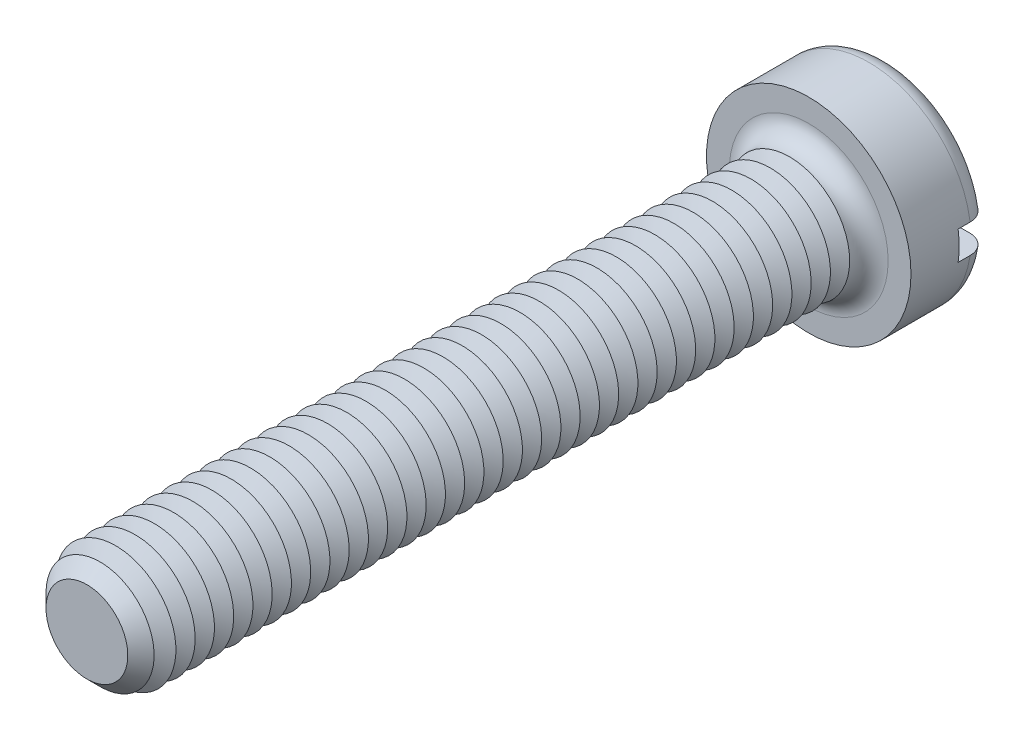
ISO-10303-21;
HEADER;
FILE_DESCRIPTION(('STEP AP214'),'2;1');
FILE_NAME('part.step','',(''),(''),'','','');
FILE_SCHEMA(('AUTOMOTIVE_DESIGN { 1 0 10303 214 1 1 1 1 }'));
ENDSEC;
DATA;
#1=APPLICATION_CONTEXT('core data for automotive mechanical design processes');
#2=APPLICATION_PROTOCOL_DEFINITION('international standard','automotive_design',2000,#1);
#3=PRODUCT_CONTEXT('',#1,'mechanical');
#4=PRODUCT('Part','Part','',(#3));
#5=PRODUCT_RELATED_PRODUCT_CATEGORY('part','',(#4));
#6=PRODUCT_DEFINITION_FORMATION('','',#4);
#7=PRODUCT_DEFINITION_CONTEXT('part definition',#1,'design');
#8=PRODUCT_DEFINITION('design','',#6,#7);
#9=PRODUCT_DEFINITION_SHAPE('','',#8);
#10=(LENGTH_UNIT() NAMED_UNIT(*) SI_UNIT(.MILLI.,.METRE.));
#11=(NAMED_UNIT(*) PLANE_ANGLE_UNIT() SI_UNIT($,.RADIAN.));
#12=(NAMED_UNIT(*) SI_UNIT($,.STERADIAN.) SOLID_ANGLE_UNIT());
#13=UNCERTAINTY_MEASURE_WITH_UNIT(LENGTH_MEASURE(1.E-05),#10,'distance_accuracy_value','');
#14=(GEOMETRIC_REPRESENTATION_CONTEXT(3) GLOBAL_UNCERTAINTY_ASSIGNED_CONTEXT((#13)) GLOBAL_UNIT_ASSIGNED_CONTEXT((#10,
#11,#12)) REPRESENTATION_CONTEXT('',''));
#15=CARTESIAN_POINT('',(0.,0.,0.));
#16=DIRECTION('',(0.,0.,1.));
#17=DIRECTION('',(1.,0.,0.));
#18=AXIS2_PLACEMENT_3D('',#15,#16,#17);
#19=CARTESIAN_POINT('',(0.,0.,-3.3));
#20=DIRECTION('',(0.,0.,1.));
#21=DIRECTION('',(1.,0.,0.));
#22=AXIS2_PLACEMENT_3D('',#19,#20,#21);
#23=PLANE('',#22);
#24=CARTESIAN_POINT('',(0.,0.,-3.3));
#25=DIRECTION('',(0.,0.,1.));
#26=DIRECTION('',(1.,0.,0.));
#27=AXIS2_PLACEMENT_3D('',#24,#25,#26);
#28=CIRCLE('',#27,3.45);
#29=CARTESIAN_POINT('',(-3.39742549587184,0.6,-3.3));
#30=VERTEX_POINT('',#29);
#31=CARTESIAN_POINT('',(3.39742549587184,0.6,-3.3));
#32=VERTEX_POINT('',#31);
#33=EDGE_CURVE('E116',#30,#32,#28,.F.);
#34=ORIENTED_EDGE('',*,*,#33,.T.);
#35=DIRECTION('',(1.,0.,0.));
#36=VECTOR('',#35,1.);
#37=CARTESIAN_POINT('',(-4.25,0.600000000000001,-3.3));
#38=LINE('',#37,#36);
#39=EDGE_CURVE('E111',#30,#32,#38,.T.);
#40=ORIENTED_EDGE('',*,*,#39,.F.);
#41=EDGE_LOOP('',(#34,#40));
#42=FACE_BOUND('',#41,.T.);
#43=ADVANCED_FACE('F39',(#42),#23,.F.);
#44=CARTESIAN_POINT('',(0.,0.,-2.5));
#45=DIRECTION('',(0.,0.,1.));
#46=DIRECTION('',(1.,0.,0.));
#47=AXIS2_PLACEMENT_3D('',#44,#45,#46);
#48=TOROIDAL_SURFACE('',#47,3.45,0.8);
#49=CARTESIAN_POINT('',(-4.06369072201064,0.600000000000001,-2.95537828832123));
#50=CARTESIAN_POINT('',(-4.03774340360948,0.600000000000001,-2.99245078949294));
#51=CARTESIAN_POINT('',(-4.00861849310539,0.600000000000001,-3.02734231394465));
#52=CARTESIAN_POINT('',(-3.94488199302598,0.600000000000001,-3.0917502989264));
#53=CARTESIAN_POINT('',(-3.91026320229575,0.600000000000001,-3.12125959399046));
#54=CARTESIAN_POINT('',(-3.83660561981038,0.600000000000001,-3.17403695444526));
#55=CARTESIAN_POINT('',(-3.79757117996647,0.6,-3.19731109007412));
#56=CARTESIAN_POINT('',(-3.71618817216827,0.6,-3.23703443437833));
#57=CARTESIAN_POINT('',(-3.67384041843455,0.6,-3.25348531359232));
#58=CARTESIAN_POINT('',(-3.58661930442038,0.6,-3.2792758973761));
#59=CARTESIAN_POINT('',(-3.54172669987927,0.6,-3.288550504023));
#60=CARTESIAN_POINT('',(-3.45102322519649,0.6,-3.29952632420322));
#61=CARTESIAN_POINT('',(-3.40521225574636,0.6,-3.30122671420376));
#62=CARTESIAN_POINT('',(-3.31340831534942,0.6,-3.29701196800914));
#63=CARTESIAN_POINT('',(-3.26741940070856,0.6,-3.29100823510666));
#64=CARTESIAN_POINT('',(-3.17708556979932,0.6,-3.27141469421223));
#65=CARTESIAN_POINT('',(-3.13274074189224,0.6,-3.25782447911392));
#66=CARTESIAN_POINT('',(-3.0466814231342,0.6,-3.22332549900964));
#67=CARTESIAN_POINT('',(-3.00498444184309,0.6,-3.20237301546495));
#68=CARTESIAN_POINT('',(-2.92572251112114,0.6,-3.15372961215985));
#69=CARTESIAN_POINT('',(-2.88815755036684,0.6,-3.12603871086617));
#70=CARTESIAN_POINT('',(-2.81847654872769,0.6,-3.06483322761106));
#71=CARTESIAN_POINT('',(-2.78633186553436,0.6,-3.03135128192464));
#72=CARTESIAN_POINT('',(-2.72824805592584,0.6,-2.95937651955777));
#73=CARTESIAN_POINT('',(-2.70230829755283,0.6,-2.92088421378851));
#74=CARTESIAN_POINT('',(-2.65791262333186,0.6,-2.84074227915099));
#75=CARTESIAN_POINT('',(-2.63932560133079,0.6,-2.79916531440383));
#76=CARTESIAN_POINT('',(-2.60958432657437,0.6,-2.7134333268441));
#77=CARTESIAN_POINT('',(-2.59842889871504,0.6,-2.66927871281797));
#78=CARTESIAN_POINT('',(-2.58411140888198,0.6,-2.58073966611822));
#79=CARTESIAN_POINT('',(-2.58077086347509,0.6,-2.5363840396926));
#80=CARTESIAN_POINT('',(-2.58167367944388,0.6,-2.44775208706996));
#81=CARTESIAN_POINT('',(-2.58591644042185,0.6,-2.40347575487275));
#82=CARTESIAN_POINT('',(-2.60175154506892,0.6,-2.31675105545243));
#83=CARTESIAN_POINT('',(-2.61326489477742,0.6,-2.27428821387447));
#84=CARTESIAN_POINT('',(-2.6431863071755,0.6,-2.19186794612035));
#85=CARTESIAN_POINT('',(-2.66159465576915,0.6,-2.15191062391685));
#86=CARTESIAN_POINT('',(-2.70494650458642,0.6,-2.07517696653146));
#87=CARTESIAN_POINT('',(-2.72995486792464,0.6,-2.03843731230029));
#88=CARTESIAN_POINT('',(-2.7856570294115,0.6,-1.96955746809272));
#89=CARTESIAN_POINT('',(-2.81635145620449,0.6,-1.93741778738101));
#90=CARTESIAN_POINT('',(-2.88329572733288,0.6,-1.87788048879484));
#91=CARTESIAN_POINT('',(-2.91965530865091,0.6,-1.85060625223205));
#92=CARTESIAN_POINT('',(-2.9963658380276,0.6,-1.80241044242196));
#93=CARTESIAN_POINT('',(-3.03671721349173,0.6,-1.78148955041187));
#94=CARTESIAN_POINT('',(-3.12111125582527,0.6,-1.74619829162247));
#95=CARTESIAN_POINT('',(-3.16521020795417,0.6,-1.73196239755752));
#96=CARTESIAN_POINT('',(-3.25516487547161,0.6,-1.71103773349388));
#97=CARTESIAN_POINT('',(-3.30102068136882,0.6,-1.70434935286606));
#98=CARTESIAN_POINT('',(-3.39352689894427,0.6,-1.69870104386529));
#99=CARTESIAN_POINT('',(-3.44018061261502,0.6,-1.69979487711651));
#100=CARTESIAN_POINT('',(-3.53263583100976,0.6,-1.70983959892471));
#101=CARTESIAN_POINT('',(-3.57843734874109,0.6,-1.71879036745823));
#102=CARTESIAN_POINT('',(-3.66763544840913,0.6,-1.74426972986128));
#103=CARTESIAN_POINT('',(-3.71104292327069,0.6,-1.76076015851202));
#104=CARTESIAN_POINT('',(-3.79442616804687,0.6,-1.80087686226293));
#105=CARTESIAN_POINT('',(-3.83440212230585,0.600000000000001,-1.82450275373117));
#106=CARTESIAN_POINT('',(-3.90929765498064,0.600000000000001,-1.87793548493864));
#107=CARTESIAN_POINT('',(-3.94426963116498,0.600000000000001,-1.90766887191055));
#108=CARTESIAN_POINT('',(-4.00864839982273,0.600000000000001,-1.9726503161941));
#109=CARTESIAN_POINT('',(-4.03805555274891,0.600000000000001,-2.00789801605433));
#110=CARTESIAN_POINT('',(-4.09009460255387,0.600000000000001,-2.08244463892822));
#111=CARTESIAN_POINT('',(-4.11280448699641,0.600000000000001,-2.12168912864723));
#112=CARTESIAN_POINT('',(-4.15124086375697,0.600000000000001,-2.2034588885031));
#113=CARTESIAN_POINT('',(-4.16696802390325,0.600000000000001,-2.24598384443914));
#114=CARTESIAN_POINT('',(-4.19085131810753,0.600000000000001,-2.33267862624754));
#115=CARTESIAN_POINT('',(-4.19907708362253,0.600000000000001,-2.37682928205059));
#116=CARTESIAN_POINT('',(-4.2079638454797,0.600000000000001,-2.46589754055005));
#117=CARTESIAN_POINT('',(-4.20862315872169,0.600000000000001,-2.51081531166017));
#118=CARTESIAN_POINT('',(-4.20236829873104,0.600000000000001,-2.59993343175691));
#119=CARTESIAN_POINT('',(-4.19548454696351,0.600000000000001,-2.64413593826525));
#120=CARTESIAN_POINT('',(-4.17439924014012,0.600000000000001,-2.73071930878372));
#121=CARTESIAN_POINT('',(-4.16020675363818,0.600000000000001,-2.77310235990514));
#122=CARTESIAN_POINT('',(-4.1318825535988,0.600000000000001,-2.83880495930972));
#123=CARTESIAN_POINT('',(-4.11991183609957,0.600000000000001,-2.86307959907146));
#124=CARTESIAN_POINT('',(-4.09356927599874,0.600000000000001,-2.91028856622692));
#125=CARTESIAN_POINT('',(-4.07919744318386,0.600000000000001,-2.9332228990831));
#126=CARTESIAN_POINT('',(-4.06369072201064,0.600000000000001,-2.95537828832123));
#127=B_SPLINE_CURVE_WITH_KNOTS('',3,(#49,#50,#51,#52,#53,#54,#55,#56,#57,#58,#59,#60,#61,#62,
#63,#64,#65,#66,#67,#68,#69,#70,#71,#72,#73,#74,#75,#76,#77,#78,#79,#80,#81,#82,#83,#84,#85,#86,
#87,#88,#89,#90,#91,#92,#93,#94,#95,#96,#97,#98,#99,#100,#101,#102,#103,#104,#105,#106,#107,
#108,#109,#110,#111,#112,#113,#114,#115,#116,#117,#118,#119,#120,#121,#122,#123,#124,#125,#126),
.UNSPECIFIED.,.T.,.F.,(4,2,2,2,2,2,2,2,2,2,2,2,2,2,2,2,2,2,2,2,2,2,2,2,2,2,2,2,2,2,2,2,2,2,2,2,
2,2,4),(0.,0.13565225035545,0.271483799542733,0.407182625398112,0.542848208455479,
0.679730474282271,0.816627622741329,0.955113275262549,1.09360635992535,1.23293614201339,
1.37226554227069,1.51083389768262,1.64938813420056,1.78534653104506,1.92128342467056,
2.0540840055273,2.18687407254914,2.31824564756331,2.44962267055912,2.58234229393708,
2.71507659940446,2.85080630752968,2.98655056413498,3.12491938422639,3.26329534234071,
3.40262816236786,3.54195885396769,3.68059194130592,3.81921757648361,3.95626453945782,
4.09330262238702,4.2286754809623,4.36403538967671,4.49812564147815,4.63224572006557,
4.76582687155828,4.89924267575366,4.98031194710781,5.0613808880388),.UNSPECIFIED.);
#128=CARTESIAN_POINT('',(-4.20743389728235,0.600000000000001,-2.50000000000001));
#129=VERTEX_POINT('',#128);
#130=EDGE_CURVE('E473',#129,#30,#127,.T.);
#131=ORIENTED_EDGE('',*,*,#130,.F.);
#132=CARTESIAN_POINT('',(0.,0.,-2.5));
#133=DIRECTION('',(0.,0.,1.));
#134=DIRECTION('',(1.,0.,0.));
#135=AXIS2_PLACEMENT_3D('',#132,#133,#134);
#136=CIRCLE('',#135,4.25);
#137=CARTESIAN_POINT('',(4.20743389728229,0.599999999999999,-2.5));
#138=VERTEX_POINT('',#137);
#139=EDGE_CURVE('E125',#138,#129,#136,.T.);
#140=ORIENTED_EDGE('',*,*,#139,.F.);
#141=CARTESIAN_POINT('',(2.63947327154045,0.6,-2.79608831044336));
#142=CARTESIAN_POINT('',(2.65655980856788,0.6,-2.83790320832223));
#143=CARTESIAN_POINT('',(2.67725642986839,0.6,-2.87828303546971));
#144=CARTESIAN_POINT('',(2.72519250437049,0.6,-2.95500233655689));
#145=CARTESIAN_POINT('',(2.75244152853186,0.6,-2.9913357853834));
#146=CARTESIAN_POINT('',(2.81257938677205,0.6,-3.05889430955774));
#147=CARTESIAN_POINT('',(2.84545995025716,0.6,-3.09012674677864));
#148=CARTESIAN_POINT('',(2.91591143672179,0.6,-3.14672620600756));
#149=CARTESIAN_POINT('',(2.95348119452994,0.6,-3.17209468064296));
#150=CARTESIAN_POINT('',(3.03291143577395,0.6,-3.21669611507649));
#151=CARTESIAN_POINT('',(3.07483186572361,0.6,-3.23582234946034));
#152=CARTESIAN_POINT('',(3.16126659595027,0.6,-3.26686062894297));
#153=CARTESIAN_POINT('',(3.2057811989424,0.6,-3.27877183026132));
#154=CARTESIAN_POINT('',(3.29669878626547,0.6,-3.29514603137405));
#155=CARTESIAN_POINT('',(3.34311773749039,0.6,-3.29952056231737));
#156=CARTESIAN_POINT('',(3.43603189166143,0.6,-3.30040472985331));
#157=CARTESIAN_POINT('',(3.48252709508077,0.6,-3.29691431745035));
#158=CARTESIAN_POINT('',(3.57420049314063,0.6,-3.28214240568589));
#159=CARTESIAN_POINT('',(3.61938038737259,0.6,-3.27087147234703));
#160=CARTESIAN_POINT('',(3.70717477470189,0.6,-3.24082890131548));
#161=CARTESIAN_POINT('',(3.74978938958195,0.6,-3.22205762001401));
#162=CARTESIAN_POINT('',(3.83078828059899,0.6,-3.17773607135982));
#163=CARTESIAN_POINT('',(3.86921015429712,0.599999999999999,-3.15225453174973));
#164=CARTESIAN_POINT('',(3.94116038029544,0.599999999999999,-3.09512672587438));
#165=CARTESIAN_POINT('',(3.9746890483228,0.599999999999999,-3.06348085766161));
#166=CARTESIAN_POINT('',(4.03545911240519,0.599999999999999,-2.99534640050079));
#167=CARTESIAN_POINT('',(4.06277344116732,0.599999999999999,-2.95892285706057));
#168=CARTESIAN_POINT('',(4.11082191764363,0.599999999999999,-2.88196698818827));
#169=CARTESIAN_POINT('',(4.13155647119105,0.599999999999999,-2.84143491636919));
#170=CARTESIAN_POINT('',(4.16563480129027,0.599999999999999,-2.75787550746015));
#171=CARTESIAN_POINT('',(4.1790544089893,0.599999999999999,-2.71487908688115));
#172=CARTESIAN_POINT('',(4.19843340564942,0.599999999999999,-2.62723691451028));
#173=CARTESIAN_POINT('',(4.20439310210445,0.599999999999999,-2.58259123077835));
#174=CARTESIAN_POINT('',(4.2086595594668,0.599999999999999,-2.49321831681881));
#175=CARTESIAN_POINT('',(4.20701422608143,0.599999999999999,-2.4484933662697));
#176=CARTESIAN_POINT('',(4.1962295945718,0.599999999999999,-2.35995704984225));
#177=CARTESIAN_POINT('',(4.18709040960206,0.599999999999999,-2.31614567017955));
#178=CARTESIAN_POINT('',(4.16160290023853,0.599999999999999,-2.23072100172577));
#179=CARTESIAN_POINT('',(4.14526169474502,0.599999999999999,-2.18910558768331));
#180=CARTESIAN_POINT('',(4.10585410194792,0.599999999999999,-2.10919238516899));
#181=CARTESIAN_POINT('',(4.08278762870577,0.599999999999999,-2.07089463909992));
#182=CARTESIAN_POINT('',(4.030487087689,0.599999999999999,-1.99851484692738));
#183=CARTESIAN_POINT('',(4.00122628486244,0.599999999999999,-1.9644521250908));
#184=CARTESIAN_POINT('',(3.93744772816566,0.599999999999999,-1.90166877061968));
#185=CARTESIAN_POINT('',(3.90292977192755,0.599999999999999,-1.87294834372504));
#186=CARTESIAN_POINT('',(3.82928727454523,0.599999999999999,-1.82137853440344));
#187=CARTESIAN_POINT('',(3.79012374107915,0.6,-1.79858484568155));
#188=CARTESIAN_POINT('',(3.70856025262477,0.6,-1.75980712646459));
#189=CARTESIAN_POINT('',(3.66616010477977,0.6,-1.74382350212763));
#190=CARTESIAN_POINT('',(3.57878495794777,0.6,-1.71891499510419));
#191=CARTESIAN_POINT('',(3.53378519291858,0.6,-1.71007699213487));
#192=CARTESIAN_POINT('',(3.44294322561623,0.6,-1.69998722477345));
#193=CARTESIAN_POINT('',(3.3971009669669,0.6,-1.69873596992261));
#194=CARTESIAN_POINT('',(3.30531297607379,0.6,-1.70385439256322));
#195=CARTESIAN_POINT('',(3.25937213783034,0.6,-1.71031204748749));
#196=CARTESIAN_POINT('',(3.1692099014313,0.6,-1.73080107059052));
#197=CARTESIAN_POINT('',(3.12498860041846,0.6,-1.74483286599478));
#198=CARTESIAN_POINT('',(3.03926209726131,0.6,-1.78018941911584));
#199=CARTESIAN_POINT('',(2.99777407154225,0.6,-1.80155586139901));
#200=CARTESIAN_POINT('',(2.91899881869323,0.6,-1.85098881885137));
#201=CARTESIAN_POINT('',(2.88171158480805,0.6,-1.8790553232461));
#202=CARTESIAN_POINT('',(2.81266124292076,0.6,-1.94094884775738));
#203=CARTESIAN_POINT('',(2.78086710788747,0.6,-1.97474122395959));
#204=CARTESIAN_POINT('',(2.72353615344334,0.6,-2.0472724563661));
#205=CARTESIAN_POINT('',(2.69799841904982,0.6,-2.08601058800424));
#206=CARTESIAN_POINT('',(2.65444718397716,0.6,-2.16655019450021));
#207=CARTESIAN_POINT('',(2.63629889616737,0.6,-2.20827875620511));
#208=CARTESIAN_POINT('',(2.60744942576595,0.6,-2.29424821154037));
#209=CARTESIAN_POINT('',(2.59674901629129,0.6,-2.33848936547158));
#210=CARTESIAN_POINT('',(2.5833312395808,0.6,-2.42714258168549));
#211=CARTESIAN_POINT('',(2.58043995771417,0.6,-2.47152848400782));
#212=CARTESIAN_POINT('',(2.58224493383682,0.6,-2.56010574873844));
#213=CARTESIAN_POINT('',(2.58693104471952,0.6,-2.60429729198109));
#214=CARTESIAN_POINT('',(2.60020046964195,0.6,-2.67311978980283));
#215=CARTESIAN_POINT('',(2.60635343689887,0.6,-2.69824441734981));
#216=CARTESIAN_POINT('',(2.62110140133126,0.6,-2.74776540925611));
#217=CARTESIAN_POINT('',(2.62969634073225,0.6,-2.77216179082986));
#218=CARTESIAN_POINT('',(2.63947327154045,0.6,-2.79608831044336));
#219=B_SPLINE_CURVE_WITH_KNOTS('',3,(#141,#142,#143,#144,#145,#146,#147,#148,#149,#150,#151,
#152,#153,#154,#155,#156,#157,#158,#159,#160,#161,#162,#163,#164,#165,#166,#167,#168,#169,#170,
#171,#172,#173,#174,#175,#176,#177,#178,#179,#180,#181,#182,#183,#184,#185,#186,#187,#188,#189,
#190,#191,#192,#193,#194,#195,#196,#197,#198,#199,#200,#201,#202,#203,#204,#205,#206,#207,#208,
#209,#210,#211,#212,#213,#214,#215,#216,#217,#218),.UNSPECIFIED.,.T.,.F.,(4,2,2,2,2,2,2,2,2,2,2,
2,2,2,2,2,2,2,2,2,2,2,2,2,2,2,2,2,2,2,2,2,2,2,2,2,2,2,4),(0.,0.135416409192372,
0.271031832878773,0.406449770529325,0.541834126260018,0.679424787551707,0.817031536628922,
0.956242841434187,1.09545501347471,1.23447850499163,1.37349539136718,1.51114036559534,
1.64877645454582,1.78470267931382,1.92062051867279,2.05510117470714,2.1895762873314,
2.32320547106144,2.45683263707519,2.59032801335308,2.72382509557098,2.85791055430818,
2.99200117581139,3.12730969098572,3.26262627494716,3.39956435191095,3.53651162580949,
3.67503685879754,3.81356990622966,3.95290367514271,4.09223721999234,4.23075602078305,
4.36925455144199,4.50509949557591,4.6409585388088,4.77376594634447,4.90639565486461,
4.98388287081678,5.06136825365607),.UNSPECIFIED.);
#220=EDGE_CURVE('E475',#32,#138,#219,.T.);
#221=ORIENTED_EDGE('',*,*,#220,.F.);
#222=ORIENTED_EDGE('',*,*,#33,.F.);
#223=EDGE_LOOP('',(#131,#140,#221,#222));
#224=FACE_BOUND('',#223,.T.);
#225=ADVANCED_FACE('F457',(#224),#48,.T.);
#226=CARTESIAN_POINT('',(0.,0.,-3.3));
#227=DIRECTION('',(0.,0.,1.));
#228=DIRECTION('',(1.,0.,0.));
#229=AXIS2_PLACEMENT_3D('',#226,#227,#228);
#230=CYLINDRICAL_SURFACE('',#229,4.25);
#231=DIRECTION('',(0.,0.,1.));
#232=VECTOR('',#231,1.);
#233=CARTESIAN_POINT('',(4.20743389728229,0.599999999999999,-3.3));
#234=LINE('',#233,#232);
#235=CARTESIAN_POINT('',(4.20743389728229,0.599999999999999,-2.));
#236=VERTEX_POINT('',#235);
#237=EDGE_CURVE('E490',#138,#236,#234,.T.);
#238=ORIENTED_EDGE('',*,*,#237,.F.);
#239=ORIENTED_EDGE('',*,*,#139,.T.);
#240=DIRECTION('',(0.,0.,1.));
#241=VECTOR('',#240,1.);
#242=CARTESIAN_POINT('',(-4.20743389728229,0.600000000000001,-3.3));
#243=LINE('',#242,#241);
#244=CARTESIAN_POINT('',(-4.20743389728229,0.600000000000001,-2.));
#245=VERTEX_POINT('',#244);
#246=EDGE_CURVE('E63',#245,#129,#243,.F.);
#247=ORIENTED_EDGE('',*,*,#246,.F.);
#248=CARTESIAN_POINT('',(0.,0.,-2.));
#249=DIRECTION('',(0.,0.,-1.));
#250=DIRECTION('',(-1.,0.,0.));
#251=AXIS2_PLACEMENT_3D('',#248,#249,#250);
#252=CIRCLE('',#251,4.25);
#253=CARTESIAN_POINT('',(-4.20743389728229,-0.599999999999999,-2.));
#254=VERTEX_POINT('',#253);
#255=EDGE_CURVE('E43',#245,#254,#252,.F.);
#256=ORIENTED_EDGE('',*,*,#255,.T.);
#257=DIRECTION('',(0.,0.,1.));
#258=VECTOR('',#257,1.);
#259=CARTESIAN_POINT('',(-4.20743389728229,-0.599999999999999,-3.3));
#260=LINE('',#259,#258);
#261=CARTESIAN_POINT('',(-4.20743389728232,-0.599999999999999,-2.5));
#262=VERTEX_POINT('',#261);
#263=EDGE_CURVE('E487',#262,#254,#260,.T.);
#264=ORIENTED_EDGE('',*,*,#263,.F.);
#265=CARTESIAN_POINT('',(4.20743389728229,-0.600000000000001,-2.5));
#266=VERTEX_POINT('',#265);
#267=EDGE_CURVE('E127',#262,#266,#136,.T.);
#268=ORIENTED_EDGE('',*,*,#267,.T.);
#269=DIRECTION('',(0.,0.,1.));
#270=VECTOR('',#269,1.);
#271=CARTESIAN_POINT('',(4.20743389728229,-0.600000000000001,-3.3));
#272=LINE('',#271,#270);
#273=CARTESIAN_POINT('',(4.20743389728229,-0.600000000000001,-2.));
#274=VERTEX_POINT('',#273);
#275=EDGE_CURVE('E55',#274,#266,#272,.F.);
#276=ORIENTED_EDGE('',*,*,#275,.F.);
#277=EDGE_CURVE('E11',#274,#236,#252,.F.);
#278=ORIENTED_EDGE('',*,*,#277,.T.);
#279=EDGE_LOOP('',(#238,#239,#247,#256,#264,#268,#276,#278));
#280=FACE_BOUND('',#279,.T.);
#281=CARTESIAN_POINT('',(0.,0.,0.));
#282=DIRECTION('',(0.,0.,1.));
#283=DIRECTION('',(1.,0.,0.));
#284=AXIS2_PLACEMENT_3D('',#281,#282,#283);
#285=CIRCLE('',#284,4.25);
#286=CARTESIAN_POINT('',(4.25,0.,0.));
#287=VERTEX_POINT('',#286);
#288=EDGE_CURVE('E493',#287,#287,#285,.T.);
#289=ORIENTED_EDGE('',*,*,#288,.F.);
#290=EDGE_LOOP('',(#289));
#291=FACE_BOUND('',#290,.T.);
#292=ADVANCED_FACE('F453',(#280,#291),#230,.T.);
#293=CARTESIAN_POINT('',(3.39742549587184,-0.6,-3.3));
#294=VERTEX_POINT('',#293);
#295=CARTESIAN_POINT('',(-3.39742549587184,-0.6,-3.3));
#296=VERTEX_POINT('',#295);
#297=EDGE_CURVE('E109',#294,#296,#28,.F.);
#298=ORIENTED_EDGE('',*,*,#297,.T.);
#299=DIRECTION('',(-1.,0.,0.));
#300=VECTOR('',#299,1.);
#301=CARTESIAN_POINT('',(-4.25,-0.599999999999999,-3.3));
#302=LINE('',#301,#300);
#303=EDGE_CURVE('E96',#294,#296,#302,.T.);
#304=ORIENTED_EDGE('',*,*,#303,.F.);
#305=EDGE_LOOP('',(#298,#304));
#306=FACE_BOUND('',#305,.T.);
#307=ADVANCED_FACE('F108',(#306),#23,.F.);
#308=CARTESIAN_POINT('',(0.,0.,0.));
#309=DIRECTION('',(0.,0.,1.));
#310=DIRECTION('',(1.,0.,0.));
#311=AXIS2_PLACEMENT_3D('',#308,#309,#310);
#312=PLANE('',#311);
#313=CARTESIAN_POINT('',(0.,0.,0.));
#314=DIRECTION('',(0.,0.,1.));
#315=DIRECTION('',(1.,0.,0.));
#316=AXIS2_PLACEMENT_3D('',#313,#314,#315);
#317=CIRCLE('',#316,3.3);
#318=CARTESIAN_POINT('',(3.3,0.,0.));
#319=VERTEX_POINT('',#318);
#320=EDGE_CURVE('E115',#319,#319,#317,.F.);
#321=ORIENTED_EDGE('',*,*,#320,.T.);
#322=EDGE_LOOP('',(#321));
#323=FACE_BOUND('',#322,.T.);
#324=ORIENTED_EDGE('',*,*,#288,.T.);
#325=EDGE_LOOP('',(#324));
#326=FACE_BOUND('',#325,.T.);
#327=ADVANCED_FACE('F452',(#323,#326),#312,.T.);
#328=CARTESIAN_POINT('',(-4.06369072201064,-0.599999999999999,-2.95537828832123));
#329=CARTESIAN_POINT('',(-4.08928577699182,-0.599999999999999,-2.91880204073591));
#330=CARTESIAN_POINT('',(-4.11182555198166,-0.599999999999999,-2.88005030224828));
#331=CARTESIAN_POINT('',(-4.15010404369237,-0.599999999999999,-2.79928452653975));
#332=CARTESIAN_POINT('',(-4.16583526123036,-0.599999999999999,-2.75726695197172));
#333=CARTESIAN_POINT('',(-4.19000286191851,-0.599999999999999,-2.67118996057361));
#334=CARTESIAN_POINT('',(-4.19844101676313,-0.599999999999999,-2.62713104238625));
#335=CARTESIAN_POINT('',(-4.20777174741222,-0.599999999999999,-2.53823222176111));
#336=CARTESIAN_POINT('',(-4.20866608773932,-0.599999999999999,-2.49339250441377));
#337=CARTESIAN_POINT('',(-4.20289683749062,-0.599999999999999,-2.40433856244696));
#338=CARTESIAN_POINT('',(-4.19625607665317,-0.599999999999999,-2.36012285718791));
#339=CARTESIAN_POINT('',(-4.17565084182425,-0.599999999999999,-2.27343166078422));
#340=CARTESIAN_POINT('',(-4.16168615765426,-0.599999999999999,-2.23095621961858));
#341=CARTESIAN_POINT('',(-4.12683188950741,-0.599999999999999,-2.14890863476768));
#342=CARTESIAN_POINT('',(-4.10593663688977,-0.599999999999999,-2.10933890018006));
#343=CARTESIAN_POINT('',(-4.05783763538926,-0.599999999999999,-2.03424145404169));
#344=CARTESIAN_POINT('',(-4.03063375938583,-0.599999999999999,-1.99871382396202));
#345=CARTESIAN_POINT('',(-3.97052236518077,-0.599999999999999,-1.93246905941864));
#346=CARTESIAN_POINT('',(-3.93758114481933,-0.599999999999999,-1.90178251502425));
#347=CARTESIAN_POINT('',(-3.86706007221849,-0.599999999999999,-1.84630837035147));
#348=CARTESIAN_POINT('',(-3.82948001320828,-0.6,-1.82152103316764));
#349=CARTESIAN_POINT('',(-3.75033766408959,-0.6,-1.77826995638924));
#350=CARTESIAN_POINT('',(-3.70873831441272,-0.6,-1.7598740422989));
#351=CARTESIAN_POINT('',(-3.62306661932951,-0.6,-1.73023196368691));
#352=CARTESIAN_POINT('',(-3.57899411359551,-0.6,-1.71898626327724));
#353=CARTESIAN_POINT('',(-3.48904845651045,-0.6,-1.70382025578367));
#354=CARTESIAN_POINT('',(-3.44315982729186,-0.6,-1.69999172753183));
#355=CARTESIAN_POINT('',(-3.35138360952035,-0.6,-1.7000083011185));
#356=CARTESIAN_POINT('',(-3.30549602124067,-0.6,-1.70385391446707));
#357=CARTESIAN_POINT('',(-3.21452492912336,-0.6,-1.71917227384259));
#358=CARTESIAN_POINT('',(-3.16945455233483,-0.6,-1.73072307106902));
#359=CARTESIAN_POINT('',(-3.08188104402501,-0.6,-1.76120640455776));
#360=CARTESIAN_POINT('',(-3.0393780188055,-0.6,-1.78013924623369));
#361=CARTESIAN_POINT('',(-2.95805296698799,-0.6,-1.82493384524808));
#362=CARTESIAN_POINT('',(-2.9192403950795,-0.6,-1.85081278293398));
#363=CARTESIAN_POINT('',(-2.84656695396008,-0.6,-1.90878317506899));
#364=CARTESIAN_POINT('',(-2.81270591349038,-0.6,-1.94087441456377));
#365=CARTESIAN_POINT('',(-2.75131050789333,-0.6,-2.01002500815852));
#366=CARTESIAN_POINT('',(-2.72371339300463,-0.6,-2.04702860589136));
#367=CARTESIAN_POINT('',(-2.67528742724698,-0.6,-2.12522869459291));
#368=CARTESIAN_POINT('',(-2.65445765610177,-0.6,-2.1664246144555));
#369=CARTESIAN_POINT('',(-2.62065354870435,-0.6,-2.25087266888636));
#370=CARTESIAN_POINT('',(-2.60751663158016,-0.6,-2.29405971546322));
#371=CARTESIAN_POINT('',(-2.58885106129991,-0.6,-2.38204659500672));
#372=CARTESIAN_POINT('',(-2.58332131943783,-0.6,-2.42684619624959));
#373=CARTESIAN_POINT('',(-2.58009777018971,-0.6,-2.51580379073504));
#374=CARTESIAN_POINT('',(-2.58224575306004,-0.6,-2.55995612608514));
#375=CARTESIAN_POINT('',(-2.59395205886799,-0.6,-2.64726495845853));
#376=CARTESIAN_POINT('',(-2.60351013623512,-0.6,-2.69042148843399));
#377=CARTESIAN_POINT('',(-2.62967159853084,-0.6,-2.77438771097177));
#378=CARTESIAN_POINT('',(-2.64625243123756,-0.6,-2.81520444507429));
#379=CARTESIAN_POINT('',(-2.68592348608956,-0.6,-2.89353901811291));
#380=CARTESIAN_POINT('',(-2.70901418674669,-0.6,-2.9310566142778));
#381=CARTESIAN_POINT('',(-2.7614318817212,-0.6,-3.00240040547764));
#382=CARTESIAN_POINT('',(-2.79085487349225,-0.6,-3.03615603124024));
#383=CARTESIAN_POINT('',(-2.85483456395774,-0.6,-3.09838834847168));
#384=CARTESIAN_POINT('',(-2.88939187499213,-0.6,-3.12686440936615));
#385=CARTESIAN_POINT('',(-2.96351967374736,-0.6,-3.17841283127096));
#386=CARTESIAN_POINT('',(-3.00318741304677,-0.6,-3.20134539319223));
#387=CARTESIAN_POINT('',(-3.08576649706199,-0.6,-3.24034364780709));
#388=CARTESIAN_POINT('',(-3.12867814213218,-0.6,-3.25640870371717));
#389=CARTESIAN_POINT('',(-3.21724048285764,-0.6,-3.28143816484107));
#390=CARTESIAN_POINT('',(-3.26292314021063,-0.6,-3.29028963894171));
#391=CARTESIAN_POINT('',(-3.35512527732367,-0.6,-3.30021681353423));
#392=CARTESIAN_POINT('',(-3.40164474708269,-0.6,-3.30129260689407));
#393=CARTESIAN_POINT('',(-3.49429978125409,-0.6,-3.29560589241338));
#394=CARTESIAN_POINT('',(-3.54043436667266,-0.6,-3.28882735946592));
#395=CARTESIAN_POINT('',(-3.63090382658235,-0.6,-3.26755492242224));
#396=CARTESIAN_POINT('',(-3.67523831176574,-0.6,-3.25305935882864));
#397=CARTESIAN_POINT('',(-3.76046509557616,-0.6,-3.21686867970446));
#398=CARTESIAN_POINT('',(-3.80138087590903,-0.599999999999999,-3.1952288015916));
#399=CARTESIAN_POINT('',(-3.8788986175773,-0.599999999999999,-3.14531817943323));
#400=CARTESIAN_POINT('',(-3.91550599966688,-0.599999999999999,-3.11705590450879));
#401=CARTESIAN_POINT('',(-3.97074313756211,-0.599999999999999,-3.06628809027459));
#402=CARTESIAN_POINT('',(-3.99100743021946,-0.599999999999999,-3.04553102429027));
#403=CARTESIAN_POINT('',(-4.02917385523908,-0.599999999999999,-3.00194762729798));
#404=CARTESIAN_POINT('',(-4.04707600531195,-0.599999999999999,-2.97912131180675));
#405=CARTESIAN_POINT('',(-4.06369072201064,-0.599999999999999,-2.95537828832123));
#406=B_SPLINE_CURVE_WITH_KNOTS('',3,(#328,#329,#330,#331,#332,#333,#334,#335,#336,#337,#338,
#339,#340,#341,#342,#343,#344,#345,#346,#347,#348,#349,#350,#351,#352,#353,#354,#355,#356,#357,
#358,#359,#360,#361,#362,#363,#364,#365,#366,#367,#368,#369,#370,#371,#372,#373,#374,#375,#376,
#377,#378,#379,#380,#381,#382,#383,#384,#385,#386,#387,#388,#389,#390,#391,#392,#393,#394,#395,
#396,#397,#398,#399,#400,#401,#402,#403,#404,#405),.UNSPECIFIED.,.T.,.F.,(4,2,2,2,2,2,2,2,2,2,2,
2,2,2,2,2,2,2,2,2,2,2,2,2,2,2,2,2,2,2,2,2,2,2,2,2,2,2,4),(0.,0.133821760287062,
0.267790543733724,0.401726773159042,0.535631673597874,0.669131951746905,0.802636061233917,
0.936249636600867,1.06986590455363,1.2042952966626,1.3387306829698,1.47455198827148,
1.61038210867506,1.74788249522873,1.88539204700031,2.02431612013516,2.16324594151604,
2.30252260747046,2.4417944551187,2.57960263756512,2.71739207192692,2.85215325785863,
2.98689515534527,3.11887666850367,3.25085380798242,3.38241030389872,3.51397647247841,
3.64769871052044,3.78143690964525,3.91826005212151,4.05509587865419,4.19403485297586,
4.33297216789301,4.47219345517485,4.61144469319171,4.74964356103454,4.887666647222,
4.97453605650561,5.06140481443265),.UNSPECIFIED.);
#407=EDGE_CURVE('E103',#296,#262,#406,.T.);
#408=ORIENTED_EDGE('',*,*,#407,.F.);
#409=ORIENTED_EDGE('',*,*,#297,.F.);
#410=CARTESIAN_POINT('',(2.63947327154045,-0.6,-2.79608831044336));
#411=CARTESIAN_POINT('',(2.62285766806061,-0.6,-2.75541510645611));
#412=CARTESIAN_POINT('',(2.60963282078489,-0.6,-2.71332585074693));
#413=CARTESIAN_POINT('',(2.59042394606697,-0.6,-2.62749460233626));
#414=CARTESIAN_POINT('',(2.58444686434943,-0.6,-2.58375106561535));
#415=CARTESIAN_POINT('',(2.57995287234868,-0.6,-2.49588524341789));
#416=CARTESIAN_POINT('',(2.58143477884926,-0.6,-2.45176301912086));
#417=CARTESIAN_POINT('',(2.59180622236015,-0.6,-2.36440906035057));
#418=CARTESIAN_POINT('',(2.60069434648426,-0.6,-2.32117715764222));
#419=CARTESIAN_POINT('',(2.62554964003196,-0.6,-2.23689909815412));
#420=CARTESIAN_POINT('',(2.6415022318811,-0.6,-2.19584863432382));
#421=CARTESIAN_POINT('',(2.67996913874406,-0.6,-2.11694797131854));
#422=CARTESIAN_POINT('',(2.70248409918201,-0.6,-2.07909808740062));
#423=CARTESIAN_POINT('',(2.75378972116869,-0.6,-2.00702296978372));
#424=CARTESIAN_POINT('',(2.7826732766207,-0.6,-1.97286389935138));
#425=CARTESIAN_POINT('',(2.84564717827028,-0.6,-1.90974167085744));
#426=CARTESIAN_POINT('',(2.87973812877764,-0.6,-1.88077911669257));
#427=CARTESIAN_POINT('',(2.95300941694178,-0.6,-1.82817307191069));
#428=CARTESIAN_POINT('',(2.99228920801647,-0.6,-1.8046680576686));
#429=CARTESIAN_POINT('',(3.07419050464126,-0.6,-1.76446470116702));
#430=CARTESIAN_POINT('',(3.11681231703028,-0.6,-1.74776698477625));
#431=CARTESIAN_POINT('',(3.20492149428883,-0.6,-1.72140945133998));
#432=CARTESIAN_POINT('',(3.25044365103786,-0.6,-1.71186578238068));
#433=CARTESIAN_POINT('',(3.34244451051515,-0.6,-1.70053183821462));
#434=CARTESIAN_POINT('',(3.38892324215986,-0.6,-1.69874179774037));
#435=CARTESIAN_POINT('',(3.48165030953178,-0.6,-1.70299737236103));
#436=CARTESIAN_POINT('',(3.52789766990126,-0.6,-1.70906439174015));
#437=CARTESIAN_POINT('',(3.61869999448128,-0.6,-1.72893768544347));
#438=CARTESIAN_POINT('',(3.6632550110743,-0.6,-1.742743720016));
#439=CARTESIAN_POINT('',(3.7490339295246,-0.6,-1.77760539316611));
#440=CARTESIAN_POINT('',(3.79028083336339,-0.600000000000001,-1.79860440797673));
#441=CARTESIAN_POINT('',(3.86860401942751,-0.600000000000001,-1.84731105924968));
#442=CARTESIAN_POINT('',(3.90568056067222,-0.600000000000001,-1.87501827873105));
#443=CARTESIAN_POINT('',(3.97412845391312,-0.600000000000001,-1.93599408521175));
#444=CARTESIAN_POINT('',(4.00556369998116,-0.600000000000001,-1.96919094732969));
#445=CARTESIAN_POINT('',(4.06233546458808,-0.600000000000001,-2.0404445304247));
#446=CARTESIAN_POINT('',(4.08767237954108,-0.600000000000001,-2.07850093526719));
#447=CARTESIAN_POINT('',(4.13122502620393,-0.600000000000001,-2.15791791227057));
#448=CARTESIAN_POINT('',(4.14951966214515,-0.600000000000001,-2.19923522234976));
#449=CARTESIAN_POINT('',(4.17884974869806,-0.600000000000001,-2.28437065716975));
#450=CARTESIAN_POINT('',(4.18988555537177,-0.600000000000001,-2.32818865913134));
#451=CARTESIAN_POINT('',(4.20430724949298,-0.600000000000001,-2.41670951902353));
#452=CARTESIAN_POINT('',(4.2077528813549,-0.600000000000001,-2.46140265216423));
#453=CARTESIAN_POINT('',(4.20706844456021,-0.600000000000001,-2.55073028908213));
#454=CARTESIAN_POINT('',(4.20293856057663,-0.600000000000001,-2.595364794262));
#455=CARTESIAN_POINT('',(4.18724926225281,-0.600000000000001,-2.68317733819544));
#456=CARTESIAN_POINT('',(4.17571081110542,-0.600000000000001,-2.72635912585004));
#457=CARTESIAN_POINT('',(4.14556645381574,-0.600000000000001,-2.81017999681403));
#458=CARTESIAN_POINT('',(4.12696052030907,-0.600000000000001,-2.85081907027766));
#459=CARTESIAN_POINT('',(4.08317014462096,-0.600000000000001,-2.92852328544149));
#460=CARTESIAN_POINT('',(4.0579684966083,-0.600000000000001,-2.96557872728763));
#461=CARTESIAN_POINT('',(4.00174565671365,-0.600000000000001,-3.034972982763));
#462=CARTESIAN_POINT('',(3.97072429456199,-0.600000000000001,-3.06731165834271));
#463=CARTESIAN_POINT('',(3.90349659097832,-0.600000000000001,-3.12662735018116));
#464=CARTESIAN_POINT('',(3.86725240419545,-0.600000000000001,-3.15356146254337));
#465=CARTESIAN_POINT('',(3.79079809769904,-0.600000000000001,-3.20104156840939));
#466=CARTESIAN_POINT('',(3.75058775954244,-0.6,-3.22158720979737));
#467=CARTESIAN_POINT('',(3.6668595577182,-0.6,-3.25595832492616));
#468=CARTESIAN_POINT('',(3.62330947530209,-0.6,-3.26970530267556));
#469=CARTESIAN_POINT('',(3.53453348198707,-0.6,-3.28979004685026));
#470=CARTESIAN_POINT('',(3.48930745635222,-0.6,-3.29612730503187));
#471=CARTESIAN_POINT('',(3.39787506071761,-0.6,-3.30128612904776));
#472=CARTESIAN_POINT('',(3.35166346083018,-0.6,-3.30001513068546));
#473=CARTESIAN_POINT('',(3.26009663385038,-0.6,-3.28980210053));
#474=CARTESIAN_POINT('',(3.21474142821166,-0.6,-3.28085987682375));
#475=CARTESIAN_POINT('',(3.12577990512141,-0.6,-3.2554540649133));
#476=CARTESIAN_POINT('',(3.08219120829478,-0.6,-3.23892872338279));
#477=CARTESIAN_POINT('',(2.99839730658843,-0.6,-3.1987810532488));
#478=CARTESIAN_POINT('',(2.95819301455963,-0.6,-3.17515681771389));
#479=CARTESIAN_POINT('',(2.88239372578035,-0.6,-3.12147666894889));
#480=CARTESIAN_POINT('',(2.84679445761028,-0.6,-3.09142678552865));
#481=CARTESIAN_POINT('',(2.78127483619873,-0.6,-3.02571584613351));
#482=CARTESIAN_POINT('',(2.75134725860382,-0.6,-2.99006203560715));
#483=CARTESIAN_POINT('',(2.70767232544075,-0.6,-2.92780516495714));
#484=CARTESIAN_POINT('',(2.69197340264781,-0.6,-2.90254809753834));
#485=CARTESIAN_POINT('',(2.66349078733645,-0.6,-2.8504392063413));
#486=CARTESIAN_POINT('',(2.65070705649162,-0.6,-2.82358740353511));
#487=CARTESIAN_POINT('',(2.63947327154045,-0.6,-2.79608831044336));
#488=B_SPLINE_CURVE_WITH_KNOTS('',3,(#410,#411,#412,#413,#414,#415,#416,#417,#418,#419,#420,
#421,#422,#423,#424,#425,#426,#427,#428,#429,#430,#431,#432,#433,#434,#435,#436,#437,#438,#439,
#440,#441,#442,#443,#444,#445,#446,#447,#448,#449,#450,#451,#452,#453,#454,#455,#456,#457,#458,
#459,#460,#461,#462,#463,#464,#465,#466,#467,#468,#469,#470,#471,#472,#473,#474,#475,#476,#477,
#478,#479,#480,#481,#482,#483,#484,#485,#486,#487),.UNSPECIFIED.,.T.,.F.,(4,2,2,2,2,2,2,2,2,2,2,
2,2,2,2,2,2,2,2,2,2,2,2,2,2,2,2,2,2,2,2,2,2,2,2,2,2,2,4),(0.,0.131701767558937,
0.263529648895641,0.395336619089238,0.527118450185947,0.658629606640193,0.790153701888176,
0.923740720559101,1.05734325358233,1.19403504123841,1.33073939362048,1.46961778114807,
1.60850037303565,1.74776210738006,1.88701952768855,2.02520497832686,2.16338184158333,
2.29987843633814,2.43636615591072,2.57127672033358,2.7061806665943,2.84001889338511,
2.97385385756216,3.1073117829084,3.24077022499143,3.37458034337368,3.50839437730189,
3.64323196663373,3.77807698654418,3.91444452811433,4.05082142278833,4.18886086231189,
4.32690375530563,4.46609131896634,4.60531630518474,4.74441121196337,4.88332773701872,
4.97237227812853,5.06141564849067),.UNSPECIFIED.);
#489=EDGE_CURVE('E92',#266,#294,#488,.T.);
#490=ORIENTED_EDGE('',*,*,#489,.F.);
#491=ORIENTED_EDGE('',*,*,#267,.F.);
#492=EDGE_LOOP('',(#408,#409,#490,#491));
#493=FACE_BOUND('',#492,.T.);
#494=ADVANCED_FACE('F113',(#493),#48,.T.);
#495=CARTESIAN_POINT('',(0.,0.,0.799999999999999));
#496=DIRECTION('',(0.,0.,1.));
#497=DIRECTION('',(1.,0.,0.));
#498=AXIS2_PLACEMENT_3D('',#495,#496,#497);
#499=TOROIDAL_SURFACE('',#498,3.3,0.8);
#500=ORIENTED_EDGE('',*,*,#320,.F.);
#501=EDGE_LOOP('',(#500));
#502=FACE_BOUND('',#501,.T.);
#503=CARTESIAN_POINT('',(0.,0.,0.799999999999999));
#504=DIRECTION('',(0.,0.,-1.));
#505=DIRECTION('',(-1.,0.,0.));
#506=AXIS2_PLACEMENT_3D('',#503,#504,#505);
#507=CIRCLE('',#506,2.5);
#508=CARTESIAN_POINT('',(-2.5,0.,0.799999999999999));
#509=VERTEX_POINT('',#508);
#510=EDGE_CURVE('E497',#509,#509,#507,.T.);
#511=ORIENTED_EDGE('',*,*,#510,.T.);
#512=EDGE_LOOP('',(#511));
#513=FACE_BOUND('',#512,.T.);
#514=ADVANCED_FACE('F445',(#502,#513),#499,.F.);
#515=CARTESIAN_POINT('',(0.,0.,1.2));
#516=DIRECTION('',(0.,0.,-1.));
#517=DIRECTION('',(-1.,0.,0.));
#518=AXIS2_PLACEMENT_3D('',#515,#516,#517);
#519=CONICAL_SURFACE('',#518,1.80717967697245,1.0471975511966);
#520=ORIENTED_EDGE('',*,*,#510,.F.);
#521=EDGE_LOOP('',(#520));
#522=FACE_BOUND('',#521,.T.);
#523=CARTESIAN_POINT('',(0.,0.,1.2));
#524=DIRECTION('',(0.,0.,-1.));
#525=DIRECTION('',(-1.,0.,0.));
#526=AXIS2_PLACEMENT_3D('',#523,#524,#525);
#527=CIRCLE('',#526,1.80717967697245);
#528=CARTESIAN_POINT('',(-1.80717967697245,0.,1.2));
#529=VERTEX_POINT('',#528);
#530=EDGE_CURVE('E502',#529,#529,#527,.T.);
#531=ORIENTED_EDGE('',*,*,#530,.T.);
#532=EDGE_LOOP('',(#531));
#533=FACE_BOUND('',#532,.T.);
#534=ADVANCED_FACE('F441',(#522,#533),#519,.T.);
#535=CARTESIAN_POINT('',(0.,0.,1.6));
#536=DIRECTION('',(0.,0.,1.));
#537=DIRECTION('',(1.,0.,0.));
#538=AXIS2_PLACEMENT_3D('',#535,#536,#537);
#539=CONICAL_SURFACE('',#538,2.5,1.0471975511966);
#540=ORIENTED_EDGE('',*,*,#530,.F.);
#541=EDGE_LOOP('',(#540));
#542=FACE_BOUND('',#541,.T.);
#543=CARTESIAN_POINT('',(0.,0.,1.6));
#544=DIRECTION('',(0.,0.,-1.));
#545=DIRECTION('',(-1.,0.,0.));
#546=AXIS2_PLACEMENT_3D('',#543,#544,#545);
#547=CIRCLE('',#546,2.5);
#548=CARTESIAN_POINT('',(-2.5,0.,1.6));
#549=VERTEX_POINT('',#548);
#550=EDGE_CURVE('E508',#549,#549,#547,.T.);
#551=ORIENTED_EDGE('',*,*,#550,.T.);
#552=EDGE_LOOP('',(#551));
#553=FACE_BOUND('',#552,.T.);
#554=ADVANCED_FACE('F437',(#542,#553),#539,.T.);
#555=CARTESIAN_POINT('',(0.,0.,2.));
#556=DIRECTION('',(0.,0.,-1.));
#557=DIRECTION('',(-1.,0.,0.));
#558=AXIS2_PLACEMENT_3D('',#555,#556,#557);
#559=CONICAL_SURFACE('',#558,1.80717967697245,1.0471975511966);
#560=ORIENTED_EDGE('',*,*,#550,.F.);
#561=EDGE_LOOP('',(#560));
#562=FACE_BOUND('',#561,.T.);
#563=CARTESIAN_POINT('',(0.,0.,2.));
#564=DIRECTION('',(0.,0.,-1.));
#565=DIRECTION('',(-1.,0.,0.));
#566=AXIS2_PLACEMENT_3D('',#563,#564,#565);
#567=CIRCLE('',#566,1.80717967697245);
#568=CARTESIAN_POINT('',(-1.80717967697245,0.,2.));
#569=VERTEX_POINT('',#568);
#570=EDGE_CURVE('E512',#569,#569,#567,.T.);
#571=ORIENTED_EDGE('',*,*,#570,.T.);
#572=EDGE_LOOP('',(#571));
#573=FACE_BOUND('',#572,.T.);
#574=ADVANCED_FACE('F433',(#562,#573),#559,.T.);
#575=CARTESIAN_POINT('',(0.,0.,2.4));
#576=DIRECTION('',(0.,0.,1.));
#577=DIRECTION('',(1.,0.,0.));
#578=AXIS2_PLACEMENT_3D('',#575,#576,#577);
#579=CONICAL_SURFACE('',#578,2.5,1.0471975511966);
#580=ORIENTED_EDGE('',*,*,#570,.F.);
#581=EDGE_LOOP('',(#580));
#582=FACE_BOUND('',#581,.T.);
#583=CARTESIAN_POINT('',(0.,0.,2.4));
#584=DIRECTION('',(0.,0.,-1.));
#585=DIRECTION('',(-1.,0.,0.));
#586=AXIS2_PLACEMENT_3D('',#583,#584,#585);
#587=CIRCLE('',#586,2.5);
#588=CARTESIAN_POINT('',(-2.5,0.,2.4));
#589=VERTEX_POINT('',#588);
#590=EDGE_CURVE('E516',#589,#589,#587,.T.);
#591=ORIENTED_EDGE('',*,*,#590,.T.);
#592=EDGE_LOOP('',(#591));
#593=FACE_BOUND('',#592,.T.);
#594=ADVANCED_FACE('F429',(#582,#593),#579,.T.);
#595=CARTESIAN_POINT('',(0.,0.,2.8));
#596=DIRECTION('',(0.,0.,-1.));
#597=DIRECTION('',(-1.,0.,0.));
#598=AXIS2_PLACEMENT_3D('',#595,#596,#597);
#599=CONICAL_SURFACE('',#598,1.80717967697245,1.0471975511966);
#600=ORIENTED_EDGE('',*,*,#590,.F.);
#601=EDGE_LOOP('',(#600));
#602=FACE_BOUND('',#601,.T.);
#603=CARTESIAN_POINT('',(0.,0.,2.8));
#604=DIRECTION('',(0.,0.,-1.));
#605=DIRECTION('',(-1.,0.,0.));
#606=AXIS2_PLACEMENT_3D('',#603,#604,#605);
#607=CIRCLE('',#606,1.80717967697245);
#608=CARTESIAN_POINT('',(-1.80717967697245,0.,2.8));
#609=VERTEX_POINT('',#608);
#610=EDGE_CURVE('E520',#609,#609,#607,.T.);
#611=ORIENTED_EDGE('',*,*,#610,.T.);
#612=EDGE_LOOP('',(#611));
#613=FACE_BOUND('',#612,.T.);
#614=ADVANCED_FACE('F425',(#602,#613),#599,.T.);
#615=CARTESIAN_POINT('',(0.,0.,3.2));
#616=DIRECTION('',(0.,0.,1.));
#617=DIRECTION('',(1.,0.,0.));
#618=AXIS2_PLACEMENT_3D('',#615,#616,#617);
#619=CONICAL_SURFACE('',#618,2.5,1.0471975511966);
#620=ORIENTED_EDGE('',*,*,#610,.F.);
#621=EDGE_LOOP('',(#620));
#622=FACE_BOUND('',#621,.T.);
#623=CARTESIAN_POINT('',(0.,0.,3.2));
#624=DIRECTION('',(0.,0.,-1.));
#625=DIRECTION('',(-1.,0.,0.));
#626=AXIS2_PLACEMENT_3D('',#623,#624,#625);
#627=CIRCLE('',#626,2.5);
#628=CARTESIAN_POINT('',(-2.5,0.,3.2));
#629=VERTEX_POINT('',#628);
#630=EDGE_CURVE('E524',#629,#629,#627,.T.);
#631=ORIENTED_EDGE('',*,*,#630,.T.);
#632=EDGE_LOOP('',(#631));
#633=FACE_BOUND('',#632,.T.);
#634=ADVANCED_FACE('F421',(#622,#633),#619,.T.);
#635=CARTESIAN_POINT('',(0.,0.,3.6));
#636=DIRECTION('',(0.,0.,-1.));
#637=DIRECTION('',(-1.,0.,0.));
#638=AXIS2_PLACEMENT_3D('',#635,#636,#637);
#639=CONICAL_SURFACE('',#638,1.80717967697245,1.0471975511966);
#640=ORIENTED_EDGE('',*,*,#630,.F.);
#641=EDGE_LOOP('',(#640));
#642=FACE_BOUND('',#641,.T.);
#643=CARTESIAN_POINT('',(0.,0.,3.6));
#644=DIRECTION('',(0.,0.,-1.));
#645=DIRECTION('',(-1.,0.,0.));
#646=AXIS2_PLACEMENT_3D('',#643,#644,#645);
#647=CIRCLE('',#646,1.80717967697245);
#648=CARTESIAN_POINT('',(-1.80717967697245,0.,3.6));
#649=VERTEX_POINT('',#648);
#650=EDGE_CURVE('E528',#649,#649,#647,.T.);
#651=ORIENTED_EDGE('',*,*,#650,.T.);
#652=EDGE_LOOP('',(#651));
#653=FACE_BOUND('',#652,.T.);
#654=ADVANCED_FACE('F417',(#642,#653),#639,.T.);
#655=CARTESIAN_POINT('',(0.,0.,4.));
#656=DIRECTION('',(0.,0.,1.));
#657=DIRECTION('',(1.,0.,0.));
#658=AXIS2_PLACEMENT_3D('',#655,#656,#657);
#659=CONICAL_SURFACE('',#658,2.5,1.0471975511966);
#660=ORIENTED_EDGE('',*,*,#650,.F.);
#661=EDGE_LOOP('',(#660));
#662=FACE_BOUND('',#661,.T.);
#663=CARTESIAN_POINT('',(0.,0.,4.));
#664=DIRECTION('',(0.,0.,-1.));
#665=DIRECTION('',(-1.,0.,0.));
#666=AXIS2_PLACEMENT_3D('',#663,#664,#665);
#667=CIRCLE('',#666,2.5);
#668=CARTESIAN_POINT('',(-2.5,0.,4.));
#669=VERTEX_POINT('',#668);
#670=EDGE_CURVE('E532',#669,#669,#667,.T.);
#671=ORIENTED_EDGE('',*,*,#670,.T.);
#672=EDGE_LOOP('',(#671));
#673=FACE_BOUND('',#672,.T.);
#674=ADVANCED_FACE('F413',(#662,#673),#659,.T.);
#675=CARTESIAN_POINT('',(0.,0.,4.4));
#676=DIRECTION('',(0.,0.,-1.));
#677=DIRECTION('',(-1.,0.,0.));
#678=AXIS2_PLACEMENT_3D('',#675,#676,#677);
#679=CONICAL_SURFACE('',#678,1.80717967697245,1.0471975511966);
#680=ORIENTED_EDGE('',*,*,#670,.F.);
#681=EDGE_LOOP('',(#680));
#682=FACE_BOUND('',#681,.T.);
#683=CARTESIAN_POINT('',(0.,0.,4.4));
#684=DIRECTION('',(0.,0.,-1.));
#685=DIRECTION('',(-1.,0.,0.));
#686=AXIS2_PLACEMENT_3D('',#683,#684,#685);
#687=CIRCLE('',#686,1.80717967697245);
#688=CARTESIAN_POINT('',(-1.80717967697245,0.,4.4));
#689=VERTEX_POINT('',#688);
#690=EDGE_CURVE('E536',#689,#689,#687,.T.);
#691=ORIENTED_EDGE('',*,*,#690,.T.);
#692=EDGE_LOOP('',(#691));
#693=FACE_BOUND('',#692,.T.);
#694=ADVANCED_FACE('F409',(#682,#693),#679,.T.);
#695=CARTESIAN_POINT('',(0.,0.,4.8));
#696=DIRECTION('',(0.,0.,1.));
#697=DIRECTION('',(1.,0.,0.));
#698=AXIS2_PLACEMENT_3D('',#695,#696,#697);
#699=CONICAL_SURFACE('',#698,2.5,1.0471975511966);
#700=ORIENTED_EDGE('',*,*,#690,.F.);
#701=EDGE_LOOP('',(#700));
#702=FACE_BOUND('',#701,.T.);
#703=CARTESIAN_POINT('',(0.,0.,4.8));
#704=DIRECTION('',(0.,0.,-1.));
#705=DIRECTION('',(-1.,0.,0.));
#706=AXIS2_PLACEMENT_3D('',#703,#704,#705);
#707=CIRCLE('',#706,2.5);
#708=CARTESIAN_POINT('',(-2.5,0.,4.8));
#709=VERTEX_POINT('',#708);
#710=EDGE_CURVE('E540',#709,#709,#707,.T.);
#711=ORIENTED_EDGE('',*,*,#710,.T.);
#712=EDGE_LOOP('',(#711));
#713=FACE_BOUND('',#712,.T.);
#714=ADVANCED_FACE('F405',(#702,#713),#699,.T.);
#715=CARTESIAN_POINT('',(0.,0.,5.2));
#716=DIRECTION('',(0.,0.,-1.));
#717=DIRECTION('',(-1.,0.,0.));
#718=AXIS2_PLACEMENT_3D('',#715,#716,#717);
#719=CONICAL_SURFACE('',#718,1.80717967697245,1.0471975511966);
#720=ORIENTED_EDGE('',*,*,#710,.F.);
#721=EDGE_LOOP('',(#720));
#722=FACE_BOUND('',#721,.T.);
#723=CARTESIAN_POINT('',(0.,0.,5.2));
#724=DIRECTION('',(0.,0.,-1.));
#725=DIRECTION('',(-1.,0.,0.));
#726=AXIS2_PLACEMENT_3D('',#723,#724,#725);
#727=CIRCLE('',#726,1.80717967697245);
#728=CARTESIAN_POINT('',(-1.80717967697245,0.,5.2));
#729=VERTEX_POINT('',#728);
#730=EDGE_CURVE('E543',#729,#729,#727,.T.);
#731=ORIENTED_EDGE('',*,*,#730,.T.);
#732=EDGE_LOOP('',(#731));
#733=FACE_BOUND('',#732,.T.);
#734=ADVANCED_FACE('F401',(#722,#733),#719,.T.);
#735=CARTESIAN_POINT('',(0.,0.,5.6));
#736=DIRECTION('',(0.,0.,1.));
#737=DIRECTION('',(1.,0.,0.));
#738=AXIS2_PLACEMENT_3D('',#735,#736,#737);
#739=CONICAL_SURFACE('',#738,2.5,1.0471975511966);
#740=ORIENTED_EDGE('',*,*,#730,.F.);
#741=EDGE_LOOP('',(#740));
#742=FACE_BOUND('',#741,.T.);
#743=CARTESIAN_POINT('',(0.,0.,5.6));
#744=DIRECTION('',(0.,0.,-1.));
#745=DIRECTION('',(-1.,0.,0.));
#746=AXIS2_PLACEMENT_3D('',#743,#744,#745);
#747=CIRCLE('',#746,2.5);
#748=CARTESIAN_POINT('',(-2.5,0.,5.6));
#749=VERTEX_POINT('',#748);
#750=EDGE_CURVE('E547',#749,#749,#747,.T.);
#751=ORIENTED_EDGE('',*,*,#750,.T.);
#752=EDGE_LOOP('',(#751));
#753=FACE_BOUND('',#752,.T.);
#754=ADVANCED_FACE('F397',(#742,#753),#739,.T.);
#755=CARTESIAN_POINT('',(0.,0.,6.));
#756=DIRECTION('',(0.,0.,-1.));
#757=DIRECTION('',(-1.,0.,0.));
#758=AXIS2_PLACEMENT_3D('',#755,#756,#757);
#759=CONICAL_SURFACE('',#758,1.80717967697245,1.0471975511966);
#760=ORIENTED_EDGE('',*,*,#750,.F.);
#761=EDGE_LOOP('',(#760));
#762=FACE_BOUND('',#761,.T.);
#763=CARTESIAN_POINT('',(0.,0.,6.));
#764=DIRECTION('',(0.,0.,-1.));
#765=DIRECTION('',(-1.,0.,0.));
#766=AXIS2_PLACEMENT_3D('',#763,#764,#765);
#767=CIRCLE('',#766,1.80717967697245);
#768=CARTESIAN_POINT('',(-1.80717967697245,0.,6.));
#769=VERTEX_POINT('',#768);
#770=EDGE_CURVE('E551',#769,#769,#767,.T.);
#771=ORIENTED_EDGE('',*,*,#770,.T.);
#772=EDGE_LOOP('',(#771));
#773=FACE_BOUND('',#772,.T.);
#774=ADVANCED_FACE('F393',(#762,#773),#759,.T.);
#775=CARTESIAN_POINT('',(0.,0.,6.4));
#776=DIRECTION('',(0.,0.,1.));
#777=DIRECTION('',(1.,0.,0.));
#778=AXIS2_PLACEMENT_3D('',#775,#776,#777);
#779=CONICAL_SURFACE('',#778,2.5,1.0471975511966);
#780=ORIENTED_EDGE('',*,*,#770,.F.);
#781=EDGE_LOOP('',(#780));
#782=FACE_BOUND('',#781,.T.);
#783=CARTESIAN_POINT('',(0.,0.,6.4));
#784=DIRECTION('',(0.,0.,-1.));
#785=DIRECTION('',(-1.,0.,0.));
#786=AXIS2_PLACEMENT_3D('',#783,#784,#785);
#787=CIRCLE('',#786,2.5);
#788=CARTESIAN_POINT('',(-2.5,0.,6.4));
#789=VERTEX_POINT('',#788);
#790=EDGE_CURVE('E555',#789,#789,#787,.T.);
#791=ORIENTED_EDGE('',*,*,#790,.T.);
#792=EDGE_LOOP('',(#791));
#793=FACE_BOUND('',#792,.T.);
#794=ADVANCED_FACE('F389',(#782,#793),#779,.T.);
#795=CARTESIAN_POINT('',(0.,0.,6.8));
#796=DIRECTION('',(0.,0.,-1.));
#797=DIRECTION('',(-1.,0.,0.));
#798=AXIS2_PLACEMENT_3D('',#795,#796,#797);
#799=CONICAL_SURFACE('',#798,1.80717967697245,1.0471975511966);
#800=ORIENTED_EDGE('',*,*,#790,.F.);
#801=EDGE_LOOP('',(#800));
#802=FACE_BOUND('',#801,.T.);
#803=CARTESIAN_POINT('',(0.,0.,6.8));
#804=DIRECTION('',(0.,0.,-1.));
#805=DIRECTION('',(-1.,0.,0.));
#806=AXIS2_PLACEMENT_3D('',#803,#804,#805);
#807=CIRCLE('',#806,1.80717967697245);
#808=CARTESIAN_POINT('',(-1.80717967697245,0.,6.8));
#809=VERTEX_POINT('',#808);
#810=EDGE_CURVE('E559',#809,#809,#807,.T.);
#811=ORIENTED_EDGE('',*,*,#810,.T.);
#812=EDGE_LOOP('',(#811));
#813=FACE_BOUND('',#812,.T.);
#814=ADVANCED_FACE('F385',(#802,#813),#799,.T.);
#815=CARTESIAN_POINT('',(0.,0.,7.2));
#816=DIRECTION('',(0.,0.,1.));
#817=DIRECTION('',(1.,0.,0.));
#818=AXIS2_PLACEMENT_3D('',#815,#816,#817);
#819=CONICAL_SURFACE('',#818,2.5,1.0471975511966);
#820=ORIENTED_EDGE('',*,*,#810,.F.);
#821=EDGE_LOOP('',(#820));
#822=FACE_BOUND('',#821,.T.);
#823=CARTESIAN_POINT('',(0.,0.,7.2));
#824=DIRECTION('',(0.,0.,-1.));
#825=DIRECTION('',(-1.,0.,0.));
#826=AXIS2_PLACEMENT_3D('',#823,#824,#825);
#827=CIRCLE('',#826,2.5);
#828=CARTESIAN_POINT('',(-2.5,0.,7.2));
#829=VERTEX_POINT('',#828);
#830=EDGE_CURVE('E563',#829,#829,#827,.T.);
#831=ORIENTED_EDGE('',*,*,#830,.T.);
#832=EDGE_LOOP('',(#831));
#833=FACE_BOUND('',#832,.T.);
#834=ADVANCED_FACE('F381',(#822,#833),#819,.T.);
#835=CARTESIAN_POINT('',(0.,0.,7.6));
#836=DIRECTION('',(0.,0.,-1.));
#837=DIRECTION('',(-1.,0.,0.));
#838=AXIS2_PLACEMENT_3D('',#835,#836,#837);
#839=CONICAL_SURFACE('',#838,1.80717967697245,1.0471975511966);
#840=ORIENTED_EDGE('',*,*,#830,.F.);
#841=EDGE_LOOP('',(#840));
#842=FACE_BOUND('',#841,.T.);
#843=CARTESIAN_POINT('',(0.,0.,7.6));
#844=DIRECTION('',(0.,0.,-1.));
#845=DIRECTION('',(-1.,0.,0.));
#846=AXIS2_PLACEMENT_3D('',#843,#844,#845);
#847=CIRCLE('',#846,1.80717967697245);
#848=CARTESIAN_POINT('',(-1.80717967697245,0.,7.6));
#849=VERTEX_POINT('',#848);
#850=EDGE_CURVE('E567',#849,#849,#847,.T.);
#851=ORIENTED_EDGE('',*,*,#850,.T.);
#852=EDGE_LOOP('',(#851));
#853=FACE_BOUND('',#852,.T.);
#854=ADVANCED_FACE('F377',(#842,#853),#839,.T.);
#855=CARTESIAN_POINT('',(0.,0.,8.));
#856=DIRECTION('',(0.,0.,1.));
#857=DIRECTION('',(1.,0.,0.));
#858=AXIS2_PLACEMENT_3D('',#855,#856,#857);
#859=CONICAL_SURFACE('',#858,2.5,1.0471975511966);
#860=ORIENTED_EDGE('',*,*,#850,.F.);
#861=EDGE_LOOP('',(#860));
#862=FACE_BOUND('',#861,.T.);
#863=CARTESIAN_POINT('',(0.,0.,8.));
#864=DIRECTION('',(0.,0.,-1.));
#865=DIRECTION('',(-1.,0.,0.));
#866=AXIS2_PLACEMENT_3D('',#863,#864,#865);
#867=CIRCLE('',#866,2.5);
#868=CARTESIAN_POINT('',(-2.5,0.,8.));
#869=VERTEX_POINT('',#868);
#870=EDGE_CURVE('E571',#869,#869,#867,.T.);
#871=ORIENTED_EDGE('',*,*,#870,.T.);
#872=EDGE_LOOP('',(#871));
#873=FACE_BOUND('',#872,.T.);
#874=ADVANCED_FACE('F373',(#862,#873),#859,.T.);
#875=CARTESIAN_POINT('',(0.,0.,8.4));
#876=DIRECTION('',(0.,0.,-1.));
#877=DIRECTION('',(-1.,0.,0.));
#878=AXIS2_PLACEMENT_3D('',#875,#876,#877);
#879=CONICAL_SURFACE('',#878,1.80717967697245,1.0471975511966);
#880=ORIENTED_EDGE('',*,*,#870,.F.);
#881=EDGE_LOOP('',(#880));
#882=FACE_BOUND('',#881,.T.);
#883=CARTESIAN_POINT('',(0.,0.,8.4));
#884=DIRECTION('',(0.,0.,-1.));
#885=DIRECTION('',(-1.,0.,0.));
#886=AXIS2_PLACEMENT_3D('',#883,#884,#885);
#887=CIRCLE('',#886,1.80717967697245);
#888=CARTESIAN_POINT('',(-1.80717967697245,0.,8.4));
#889=VERTEX_POINT('',#888);
#890=EDGE_CURVE('E574',#889,#889,#887,.T.);
#891=ORIENTED_EDGE('',*,*,#890,.T.);
#892=EDGE_LOOP('',(#891));
#893=FACE_BOUND('',#892,.T.);
#894=ADVANCED_FACE('F369',(#882,#893),#879,.T.);
#895=CARTESIAN_POINT('',(0.,0.,8.8));
#896=DIRECTION('',(0.,0.,1.));
#897=DIRECTION('',(1.,0.,0.));
#898=AXIS2_PLACEMENT_3D('',#895,#896,#897);
#899=CONICAL_SURFACE('',#898,2.5,1.0471975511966);
#900=ORIENTED_EDGE('',*,*,#890,.F.);
#901=EDGE_LOOP('',(#900));
#902=FACE_BOUND('',#901,.T.);
#903=CARTESIAN_POINT('',(0.,0.,8.8));
#904=DIRECTION('',(0.,0.,-1.));
#905=DIRECTION('',(-1.,0.,0.));
#906=AXIS2_PLACEMENT_3D('',#903,#904,#905);
#907=CIRCLE('',#906,2.5);
#908=CARTESIAN_POINT('',(-2.5,0.,8.8));
#909=VERTEX_POINT('',#908);
#910=EDGE_CURVE('E578',#909,#909,#907,.T.);
#911=ORIENTED_EDGE('',*,*,#910,.T.);
#912=EDGE_LOOP('',(#911));
#913=FACE_BOUND('',#912,.T.);
#914=ADVANCED_FACE('F365',(#902,#913),#899,.T.);
#915=CARTESIAN_POINT('',(0.,0.,9.2));
#916=DIRECTION('',(0.,0.,-1.));
#917=DIRECTION('',(-1.,0.,0.));
#918=AXIS2_PLACEMENT_3D('',#915,#916,#917);
#919=CONICAL_SURFACE('',#918,1.80717967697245,1.0471975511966);
#920=ORIENTED_EDGE('',*,*,#910,.F.);
#921=EDGE_LOOP('',(#920));
#922=FACE_BOUND('',#921,.T.);
#923=CARTESIAN_POINT('',(0.,0.,9.2));
#924=DIRECTION('',(0.,0.,-1.));
#925=DIRECTION('',(-1.,0.,0.));
#926=AXIS2_PLACEMENT_3D('',#923,#924,#925);
#927=CIRCLE('',#926,1.80717967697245);
#928=CARTESIAN_POINT('',(-1.80717967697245,0.,9.2));
#929=VERTEX_POINT('',#928);
#930=EDGE_CURVE('E582',#929,#929,#927,.T.);
#931=ORIENTED_EDGE('',*,*,#930,.T.);
#932=EDGE_LOOP('',(#931));
#933=FACE_BOUND('',#932,.T.);
#934=ADVANCED_FACE('F361',(#922,#933),#919,.T.);
#935=CARTESIAN_POINT('',(0.,0.,9.6));
#936=DIRECTION('',(0.,0.,1.));
#937=DIRECTION('',(1.,0.,0.));
#938=AXIS2_PLACEMENT_3D('',#935,#936,#937);
#939=CONICAL_SURFACE('',#938,2.5,1.0471975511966);
#940=ORIENTED_EDGE('',*,*,#930,.F.);
#941=EDGE_LOOP('',(#940));
#942=FACE_BOUND('',#941,.T.);
#943=CARTESIAN_POINT('',(0.,0.,9.6));
#944=DIRECTION('',(0.,0.,-1.));
#945=DIRECTION('',(-1.,0.,0.));
#946=AXIS2_PLACEMENT_3D('',#943,#944,#945);
#947=CIRCLE('',#946,2.5);
#948=CARTESIAN_POINT('',(-2.5,0.,9.6));
#949=VERTEX_POINT('',#948);
#950=EDGE_CURVE('E586',#949,#949,#947,.T.);
#951=ORIENTED_EDGE('',*,*,#950,.T.);
#952=EDGE_LOOP('',(#951));
#953=FACE_BOUND('',#952,.T.);
#954=ADVANCED_FACE('F357',(#942,#953),#939,.T.);
#955=CARTESIAN_POINT('',(0.,0.,10.));
#956=DIRECTION('',(0.,0.,-1.));
#957=DIRECTION('',(-1.,0.,0.));
#958=AXIS2_PLACEMENT_3D('',#955,#956,#957);
#959=CONICAL_SURFACE('',#958,1.80717967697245,1.0471975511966);
#960=ORIENTED_EDGE('',*,*,#950,.F.);
#961=EDGE_LOOP('',(#960));
#962=FACE_BOUND('',#961,.T.);
#963=CARTESIAN_POINT('',(0.,0.,10.));
#964=DIRECTION('',(0.,0.,-1.));
#965=DIRECTION('',(-1.,0.,0.));
#966=AXIS2_PLACEMENT_3D('',#963,#964,#965);
#967=CIRCLE('',#966,1.80717967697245);
#968=CARTESIAN_POINT('',(-1.80717967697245,0.,10.));
#969=VERTEX_POINT('',#968);
#970=EDGE_CURVE('E590',#969,#969,#967,.T.);
#971=ORIENTED_EDGE('',*,*,#970,.T.);
#972=EDGE_LOOP('',(#971));
#973=FACE_BOUND('',#972,.T.);
#974=ADVANCED_FACE('F353',(#962,#973),#959,.T.);
#975=CARTESIAN_POINT('',(0.,0.,10.4));
#976=DIRECTION('',(0.,0.,1.));
#977=DIRECTION('',(1.,0.,0.));
#978=AXIS2_PLACEMENT_3D('',#975,#976,#977);
#979=CONICAL_SURFACE('',#978,2.5,1.0471975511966);
#980=ORIENTED_EDGE('',*,*,#970,.F.);
#981=EDGE_LOOP('',(#980));
#982=FACE_BOUND('',#981,.T.);
#983=CARTESIAN_POINT('',(0.,0.,10.4));
#984=DIRECTION('',(0.,0.,-1.));
#985=DIRECTION('',(-1.,0.,0.));
#986=AXIS2_PLACEMENT_3D('',#983,#984,#985);
#987=CIRCLE('',#986,2.5);
#988=CARTESIAN_POINT('',(-2.5,0.,10.4));
#989=VERTEX_POINT('',#988);
#990=EDGE_CURVE('E594',#989,#989,#987,.T.);
#991=ORIENTED_EDGE('',*,*,#990,.T.);
#992=EDGE_LOOP('',(#991));
#993=FACE_BOUND('',#992,.T.);
#994=ADVANCED_FACE('F349',(#982,#993),#979,.T.);
#995=CARTESIAN_POINT('',(0.,0.,10.8));
#996=DIRECTION('',(0.,0.,-1.));
#997=DIRECTION('',(-1.,0.,0.));
#998=AXIS2_PLACEMENT_3D('',#995,#996,#997);
#999=CONICAL_SURFACE('',#998,1.80717967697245,1.0471975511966);
#1000=ORIENTED_EDGE('',*,*,#990,.F.);
#1001=EDGE_LOOP('',(#1000));
#1002=FACE_BOUND('',#1001,.T.);
#1003=CARTESIAN_POINT('',(0.,0.,10.8));
#1004=DIRECTION('',(0.,0.,-1.));
#1005=DIRECTION('',(-1.,0.,0.));
#1006=AXIS2_PLACEMENT_3D('',#1003,#1004,#1005);
#1007=CIRCLE('',#1006,1.80717967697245);
#1008=CARTESIAN_POINT('',(-1.80717967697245,0.,10.8));
#1009=VERTEX_POINT('',#1008);
#1010=EDGE_CURVE('E598',#1009,#1009,#1007,.T.);
#1011=ORIENTED_EDGE('',*,*,#1010,.T.);
#1012=EDGE_LOOP('',(#1011));
#1013=FACE_BOUND('',#1012,.T.);
#1014=ADVANCED_FACE('F345',(#1002,#1013),#999,.T.);
#1015=CARTESIAN_POINT('',(0.,0.,11.2));
#1016=DIRECTION('',(0.,0.,1.));
#1017=DIRECTION('',(1.,0.,0.));
#1018=AXIS2_PLACEMENT_3D('',#1015,#1016,#1017);
#1019=CONICAL_SURFACE('',#1018,2.5,1.0471975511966);
#1020=ORIENTED_EDGE('',*,*,#1010,.F.);
#1021=EDGE_LOOP('',(#1020));
#1022=FACE_BOUND('',#1021,.T.);
#1023=CARTESIAN_POINT('',(0.,0.,11.2));
#1024=DIRECTION('',(0.,0.,-1.));
#1025=DIRECTION('',(-1.,0.,0.));
#1026=AXIS2_PLACEMENT_3D('',#1023,#1024,#1025);
#1027=CIRCLE('',#1026,2.5);
#1028=CARTESIAN_POINT('',(-2.5,0.,11.2));
#1029=VERTEX_POINT('',#1028);
#1030=EDGE_CURVE('E601',#1029,#1029,#1027,.T.);
#1031=ORIENTED_EDGE('',*,*,#1030,.T.);
#1032=EDGE_LOOP('',(#1031));
#1033=FACE_BOUND('',#1032,.T.);
#1034=ADVANCED_FACE('F341',(#1022,#1033),#1019,.T.);
#1035=CARTESIAN_POINT('',(0.,0.,11.6));
#1036=DIRECTION('',(0.,0.,-1.));
#1037=DIRECTION('',(-1.,0.,0.));
#1038=AXIS2_PLACEMENT_3D('',#1035,#1036,#1037);
#1039=CONICAL_SURFACE('',#1038,1.80717967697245,1.0471975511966);
#1040=ORIENTED_EDGE('',*,*,#1030,.F.);
#1041=EDGE_LOOP('',(#1040));
#1042=FACE_BOUND('',#1041,.T.);
#1043=CARTESIAN_POINT('',(0.,0.,11.6));
#1044=DIRECTION('',(0.,0.,-1.));
#1045=DIRECTION('',(-1.,0.,0.));
#1046=AXIS2_PLACEMENT_3D('',#1043,#1044,#1045);
#1047=CIRCLE('',#1046,1.80717967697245);
#1048=CARTESIAN_POINT('',(-1.80717967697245,0.,11.6));
#1049=VERTEX_POINT('',#1048);
#1050=EDGE_CURVE('E605',#1049,#1049,#1047,.T.);
#1051=ORIENTED_EDGE('',*,*,#1050,.T.);
#1052=EDGE_LOOP('',(#1051));
#1053=FACE_BOUND('',#1052,.T.);
#1054=ADVANCED_FACE('F337',(#1042,#1053),#1039,.T.);
#1055=CARTESIAN_POINT('',(0.,0.,12.));
#1056=DIRECTION('',(0.,0.,1.));
#1057=DIRECTION('',(1.,0.,0.));
#1058=AXIS2_PLACEMENT_3D('',#1055,#1056,#1057);
#1059=CONICAL_SURFACE('',#1058,2.5,1.0471975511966);
#1060=ORIENTED_EDGE('',*,*,#1050,.F.);
#1061=EDGE_LOOP('',(#1060));
#1062=FACE_BOUND('',#1061,.T.);
#1063=CARTESIAN_POINT('',(0.,0.,12.));
#1064=DIRECTION('',(0.,0.,-1.));
#1065=DIRECTION('',(-1.,0.,0.));
#1066=AXIS2_PLACEMENT_3D('',#1063,#1064,#1065);
#1067=CIRCLE('',#1066,2.5);
#1068=CARTESIAN_POINT('',(-2.5,0.,12.));
#1069=VERTEX_POINT('',#1068);
#1070=EDGE_CURVE('E609',#1069,#1069,#1067,.T.);
#1071=ORIENTED_EDGE('',*,*,#1070,.T.);
#1072=EDGE_LOOP('',(#1071));
#1073=FACE_BOUND('',#1072,.T.);
#1074=ADVANCED_FACE('F333',(#1062,#1073),#1059,.T.);
#1075=CARTESIAN_POINT('',(0.,0.,12.4));
#1076=DIRECTION('',(0.,0.,-1.));
#1077=DIRECTION('',(-1.,0.,0.));
#1078=AXIS2_PLACEMENT_3D('',#1075,#1076,#1077);
#1079=CONICAL_SURFACE('',#1078,1.80717967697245,1.0471975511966);
#1080=ORIENTED_EDGE('',*,*,#1070,.F.);
#1081=EDGE_LOOP('',(#1080));
#1082=FACE_BOUND('',#1081,.T.);
#1083=CARTESIAN_POINT('',(0.,0.,12.4));
#1084=DIRECTION('',(0.,0.,-1.));
#1085=DIRECTION('',(-1.,0.,0.));
#1086=AXIS2_PLACEMENT_3D('',#1083,#1084,#1085);
#1087=CIRCLE('',#1086,1.80717967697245);
#1088=CARTESIAN_POINT('',(-1.80717967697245,0.,12.4));
#1089=VERTEX_POINT('',#1088);
#1090=EDGE_CURVE('E613',#1089,#1089,#1087,.T.);
#1091=ORIENTED_EDGE('',*,*,#1090,.T.);
#1092=EDGE_LOOP('',(#1091));
#1093=FACE_BOUND('',#1092,.T.);
#1094=ADVANCED_FACE('F329',(#1082,#1093),#1079,.T.);
#1095=CARTESIAN_POINT('',(0.,0.,12.8));
#1096=DIRECTION('',(0.,0.,1.));
#1097=DIRECTION('',(1.,0.,0.));
#1098=AXIS2_PLACEMENT_3D('',#1095,#1096,#1097);
#1099=CONICAL_SURFACE('',#1098,2.5,1.0471975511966);
#1100=ORIENTED_EDGE('',*,*,#1090,.F.);
#1101=EDGE_LOOP('',(#1100));
#1102=FACE_BOUND('',#1101,.T.);
#1103=CARTESIAN_POINT('',(0.,0.,12.8));
#1104=DIRECTION('',(0.,0.,-1.));
#1105=DIRECTION('',(-1.,0.,0.));
#1106=AXIS2_PLACEMENT_3D('',#1103,#1104,#1105);
#1107=CIRCLE('',#1106,2.5);
#1108=CARTESIAN_POINT('',(-2.5,0.,12.8));
#1109=VERTEX_POINT('',#1108);
#1110=EDGE_CURVE('E617',#1109,#1109,#1107,.T.);
#1111=ORIENTED_EDGE('',*,*,#1110,.T.);
#1112=EDGE_LOOP('',(#1111));
#1113=FACE_BOUND('',#1112,.T.);
#1114=ADVANCED_FACE('F325',(#1102,#1113),#1099,.T.);
#1115=CARTESIAN_POINT('',(0.,0.,13.2));
#1116=DIRECTION('',(0.,0.,-1.));
#1117=DIRECTION('',(-1.,0.,0.));
#1118=AXIS2_PLACEMENT_3D('',#1115,#1116,#1117);
#1119=CONICAL_SURFACE('',#1118,1.80717967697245,1.0471975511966);
#1120=ORIENTED_EDGE('',*,*,#1110,.F.);
#1121=EDGE_LOOP('',(#1120));
#1122=FACE_BOUND('',#1121,.T.);
#1123=CARTESIAN_POINT('',(0.,0.,13.2));
#1124=DIRECTION('',(0.,0.,-1.));
#1125=DIRECTION('',(-1.,0.,0.));
#1126=AXIS2_PLACEMENT_3D('',#1123,#1124,#1125);
#1127=CIRCLE('',#1126,1.80717967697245);
#1128=CARTESIAN_POINT('',(-1.80717967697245,0.,13.2));
#1129=VERTEX_POINT('',#1128);
#1130=EDGE_CURVE('E621',#1129,#1129,#1127,.T.);
#1131=ORIENTED_EDGE('',*,*,#1130,.T.);
#1132=EDGE_LOOP('',(#1131));
#1133=FACE_BOUND('',#1132,.T.);
#1134=ADVANCED_FACE('F321',(#1122,#1133),#1119,.T.);
#1135=CARTESIAN_POINT('',(0.,0.,13.6));
#1136=DIRECTION('',(0.,0.,1.));
#1137=DIRECTION('',(1.,0.,0.));
#1138=AXIS2_PLACEMENT_3D('',#1135,#1136,#1137);
#1139=CONICAL_SURFACE('',#1138,2.5,1.0471975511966);
#1140=ORIENTED_EDGE('',*,*,#1130,.F.);
#1141=EDGE_LOOP('',(#1140));
#1142=FACE_BOUND('',#1141,.T.);
#1143=CARTESIAN_POINT('',(0.,0.,13.6));
#1144=DIRECTION('',(0.,0.,-1.));
#1145=DIRECTION('',(-1.,0.,0.));
#1146=AXIS2_PLACEMENT_3D('',#1143,#1144,#1145);
#1147=CIRCLE('',#1146,2.5);
#1148=CARTESIAN_POINT('',(-2.5,0.,13.6));
#1149=VERTEX_POINT('',#1148);
#1150=EDGE_CURVE('E625',#1149,#1149,#1147,.T.);
#1151=ORIENTED_EDGE('',*,*,#1150,.T.);
#1152=EDGE_LOOP('',(#1151));
#1153=FACE_BOUND('',#1152,.T.);
#1154=ADVANCED_FACE('F317',(#1142,#1153),#1139,.T.);
#1155=CARTESIAN_POINT('',(0.,0.,14.));
#1156=DIRECTION('',(0.,0.,-1.));
#1157=DIRECTION('',(-1.,0.,0.));
#1158=AXIS2_PLACEMENT_3D('',#1155,#1156,#1157);
#1159=CONICAL_SURFACE('',#1158,1.80717967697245,1.0471975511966);
#1160=ORIENTED_EDGE('',*,*,#1150,.F.);
#1161=EDGE_LOOP('',(#1160));
#1162=FACE_BOUND('',#1161,.T.);
#1163=CARTESIAN_POINT('',(0.,0.,14.));
#1164=DIRECTION('',(0.,0.,-1.));
#1165=DIRECTION('',(-1.,0.,0.));
#1166=AXIS2_PLACEMENT_3D('',#1163,#1164,#1165);
#1167=CIRCLE('',#1166,1.80717967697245);
#1168=CARTESIAN_POINT('',(-1.80717967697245,0.,14.));
#1169=VERTEX_POINT('',#1168);
#1170=EDGE_CURVE('E629',#1169,#1169,#1167,.T.);
#1171=ORIENTED_EDGE('',*,*,#1170,.T.);
#1172=EDGE_LOOP('',(#1171));
#1173=FACE_BOUND('',#1172,.T.);
#1174=ADVANCED_FACE('F313',(#1162,#1173),#1159,.T.);
#1175=CARTESIAN_POINT('',(0.,0.,14.4));
#1176=DIRECTION('',(0.,0.,1.));
#1177=DIRECTION('',(1.,0.,0.));
#1178=AXIS2_PLACEMENT_3D('',#1175,#1176,#1177);
#1179=CONICAL_SURFACE('',#1178,2.5,1.0471975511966);
#1180=ORIENTED_EDGE('',*,*,#1170,.F.);
#1181=EDGE_LOOP('',(#1180));
#1182=FACE_BOUND('',#1181,.T.);
#1183=CARTESIAN_POINT('',(0.,0.,14.4));
#1184=DIRECTION('',(0.,0.,-1.));
#1185=DIRECTION('',(-1.,0.,0.));
#1186=AXIS2_PLACEMENT_3D('',#1183,#1184,#1185);
#1187=CIRCLE('',#1186,2.5);
#1188=CARTESIAN_POINT('',(-2.5,0.,14.4));
#1189=VERTEX_POINT('',#1188);
#1190=EDGE_CURVE('E633',#1189,#1189,#1187,.T.);
#1191=ORIENTED_EDGE('',*,*,#1190,.T.);
#1192=EDGE_LOOP('',(#1191));
#1193=FACE_BOUND('',#1192,.T.);
#1194=ADVANCED_FACE('F309',(#1182,#1193),#1179,.T.);
#1195=CARTESIAN_POINT('',(0.,0.,14.8));
#1196=DIRECTION('',(0.,0.,-1.));
#1197=DIRECTION('',(-1.,0.,0.));
#1198=AXIS2_PLACEMENT_3D('',#1195,#1196,#1197);
#1199=CONICAL_SURFACE('',#1198,1.80717967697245,1.0471975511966);
#1200=ORIENTED_EDGE('',*,*,#1190,.F.);
#1201=EDGE_LOOP('',(#1200));
#1202=FACE_BOUND('',#1201,.T.);
#1203=CARTESIAN_POINT('',(0.,0.,14.8));
#1204=DIRECTION('',(0.,0.,-1.));
#1205=DIRECTION('',(-1.,0.,0.));
#1206=AXIS2_PLACEMENT_3D('',#1203,#1204,#1205);
#1207=CIRCLE('',#1206,1.80717967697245);
#1208=CARTESIAN_POINT('',(-1.80717967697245,0.,14.8));
#1209=VERTEX_POINT('',#1208);
#1210=EDGE_CURVE('E637',#1209,#1209,#1207,.T.);
#1211=ORIENTED_EDGE('',*,*,#1210,.T.);
#1212=EDGE_LOOP('',(#1211));
#1213=FACE_BOUND('',#1212,.T.);
#1214=ADVANCED_FACE('F305',(#1202,#1213),#1199,.T.);
#1215=CARTESIAN_POINT('',(0.,0.,15.2));
#1216=DIRECTION('',(0.,0.,1.));
#1217=DIRECTION('',(1.,0.,0.));
#1218=AXIS2_PLACEMENT_3D('',#1215,#1216,#1217);
#1219=CONICAL_SURFACE('',#1218,2.5,1.0471975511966);
#1220=ORIENTED_EDGE('',*,*,#1210,.F.);
#1221=EDGE_LOOP('',(#1220));
#1222=FACE_BOUND('',#1221,.T.);
#1223=CARTESIAN_POINT('',(0.,0.,15.2));
#1224=DIRECTION('',(0.,0.,-1.));
#1225=DIRECTION('',(-1.,0.,0.));
#1226=AXIS2_PLACEMENT_3D('',#1223,#1224,#1225);
#1227=CIRCLE('',#1226,2.5);
#1228=CARTESIAN_POINT('',(-2.5,0.,15.2));
#1229=VERTEX_POINT('',#1228);
#1230=EDGE_CURVE('E641',#1229,#1229,#1227,.T.);
#1231=ORIENTED_EDGE('',*,*,#1230,.T.);
#1232=EDGE_LOOP('',(#1231));
#1233=FACE_BOUND('',#1232,.T.);
#1234=ADVANCED_FACE('F301',(#1222,#1233),#1219,.T.);
#1235=CARTESIAN_POINT('',(0.,0.,15.6));
#1236=DIRECTION('',(0.,0.,-1.));
#1237=DIRECTION('',(-1.,0.,0.));
#1238=AXIS2_PLACEMENT_3D('',#1235,#1236,#1237);
#1239=CONICAL_SURFACE('',#1238,1.80717967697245,1.0471975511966);
#1240=ORIENTED_EDGE('',*,*,#1230,.F.);
#1241=EDGE_LOOP('',(#1240));
#1242=FACE_BOUND('',#1241,.T.);
#1243=CARTESIAN_POINT('',(0.,0.,15.6));
#1244=DIRECTION('',(0.,0.,-1.));
#1245=DIRECTION('',(-1.,0.,0.));
#1246=AXIS2_PLACEMENT_3D('',#1243,#1244,#1245);
#1247=CIRCLE('',#1246,1.80717967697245);
#1248=CARTESIAN_POINT('',(-1.80717967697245,0.,15.6));
#1249=VERTEX_POINT('',#1248);
#1250=EDGE_CURVE('E645',#1249,#1249,#1247,.T.);
#1251=ORIENTED_EDGE('',*,*,#1250,.T.);
#1252=EDGE_LOOP('',(#1251));
#1253=FACE_BOUND('',#1252,.T.);
#1254=ADVANCED_FACE('F297',(#1242,#1253),#1239,.T.);
#1255=CARTESIAN_POINT('',(0.,0.,16.));
#1256=DIRECTION('',(0.,0.,1.));
#1257=DIRECTION('',(1.,0.,0.));
#1258=AXIS2_PLACEMENT_3D('',#1255,#1256,#1257);
#1259=CONICAL_SURFACE('',#1258,2.5,1.0471975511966);
#1260=ORIENTED_EDGE('',*,*,#1250,.F.);
#1261=EDGE_LOOP('',(#1260));
#1262=FACE_BOUND('',#1261,.T.);
#1263=CARTESIAN_POINT('',(0.,0.,16.));
#1264=DIRECTION('',(0.,0.,-1.));
#1265=DIRECTION('',(-1.,0.,0.));
#1266=AXIS2_PLACEMENT_3D('',#1263,#1264,#1265);
#1267=CIRCLE('',#1266,2.5);
#1268=CARTESIAN_POINT('',(-2.5,0.,16.));
#1269=VERTEX_POINT('',#1268);
#1270=EDGE_CURVE('E649',#1269,#1269,#1267,.T.);
#1271=ORIENTED_EDGE('',*,*,#1270,.T.);
#1272=EDGE_LOOP('',(#1271));
#1273=FACE_BOUND('',#1272,.T.);
#1274=ADVANCED_FACE('F293',(#1262,#1273),#1259,.T.);
#1275=CARTESIAN_POINT('',(0.,0.,16.4));
#1276=DIRECTION('',(0.,0.,-1.));
#1277=DIRECTION('',(-1.,0.,0.));
#1278=AXIS2_PLACEMENT_3D('',#1275,#1276,#1277);
#1279=CONICAL_SURFACE('',#1278,1.80717967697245,1.0471975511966);
#1280=ORIENTED_EDGE('',*,*,#1270,.F.);
#1281=EDGE_LOOP('',(#1280));
#1282=FACE_BOUND('',#1281,.T.);
#1283=CARTESIAN_POINT('',(0.,0.,16.4));
#1284=DIRECTION('',(0.,0.,-1.));
#1285=DIRECTION('',(-1.,0.,0.));
#1286=AXIS2_PLACEMENT_3D('',#1283,#1284,#1285);
#1287=CIRCLE('',#1286,1.80717967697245);
#1288=CARTESIAN_POINT('',(-1.80717967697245,0.,16.4));
#1289=VERTEX_POINT('',#1288);
#1290=EDGE_CURVE('E653',#1289,#1289,#1287,.T.);
#1291=ORIENTED_EDGE('',*,*,#1290,.T.);
#1292=EDGE_LOOP('',(#1291));
#1293=FACE_BOUND('',#1292,.T.);
#1294=ADVANCED_FACE('F289',(#1282,#1293),#1279,.T.);
#1295=CARTESIAN_POINT('',(0.,0.,16.8));
#1296=DIRECTION('',(0.,0.,1.));
#1297=DIRECTION('',(1.,0.,0.));
#1298=AXIS2_PLACEMENT_3D('',#1295,#1296,#1297);
#1299=CONICAL_SURFACE('',#1298,2.5,1.0471975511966);
#1300=ORIENTED_EDGE('',*,*,#1290,.F.);
#1301=EDGE_LOOP('',(#1300));
#1302=FACE_BOUND('',#1301,.T.);
#1303=CARTESIAN_POINT('',(0.,0.,16.8));
#1304=DIRECTION('',(0.,0.,-1.));
#1305=DIRECTION('',(-1.,0.,0.));
#1306=AXIS2_PLACEMENT_3D('',#1303,#1304,#1305);
#1307=CIRCLE('',#1306,2.5);
#1308=CARTESIAN_POINT('',(-2.5,0.,16.8));
#1309=VERTEX_POINT('',#1308);
#1310=EDGE_CURVE('E657',#1309,#1309,#1307,.T.);
#1311=ORIENTED_EDGE('',*,*,#1310,.T.);
#1312=EDGE_LOOP('',(#1311));
#1313=FACE_BOUND('',#1312,.T.);
#1314=ADVANCED_FACE('F285',(#1302,#1313),#1299,.T.);
#1315=CARTESIAN_POINT('',(0.,0.,17.2));
#1316=DIRECTION('',(0.,0.,-1.));
#1317=DIRECTION('',(-1.,0.,0.));
#1318=AXIS2_PLACEMENT_3D('',#1315,#1316,#1317);
#1319=CONICAL_SURFACE('',#1318,1.80717967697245,1.0471975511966);
#1320=ORIENTED_EDGE('',*,*,#1310,.F.);
#1321=EDGE_LOOP('',(#1320));
#1322=FACE_BOUND('',#1321,.T.);
#1323=CARTESIAN_POINT('',(0.,0.,17.2));
#1324=DIRECTION('',(0.,0.,-1.));
#1325=DIRECTION('',(-1.,0.,0.));
#1326=AXIS2_PLACEMENT_3D('',#1323,#1324,#1325);
#1327=CIRCLE('',#1326,1.80717967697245);
#1328=CARTESIAN_POINT('',(-1.80717967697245,0.,17.2));
#1329=VERTEX_POINT('',#1328);
#1330=EDGE_CURVE('E661',#1329,#1329,#1327,.T.);
#1331=ORIENTED_EDGE('',*,*,#1330,.T.);
#1332=EDGE_LOOP('',(#1331));
#1333=FACE_BOUND('',#1332,.T.);
#1334=ADVANCED_FACE('F281',(#1322,#1333),#1319,.T.);
#1335=CARTESIAN_POINT('',(0.,0.,17.6));
#1336=DIRECTION('',(0.,0.,1.));
#1337=DIRECTION('',(1.,0.,0.));
#1338=AXIS2_PLACEMENT_3D('',#1335,#1336,#1337);
#1339=CONICAL_SURFACE('',#1338,2.5,1.0471975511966);
#1340=ORIENTED_EDGE('',*,*,#1330,.F.);
#1341=EDGE_LOOP('',(#1340));
#1342=FACE_BOUND('',#1341,.T.);
#1343=CARTESIAN_POINT('',(0.,0.,17.6));
#1344=DIRECTION('',(0.,0.,-1.));
#1345=DIRECTION('',(-1.,0.,0.));
#1346=AXIS2_PLACEMENT_3D('',#1343,#1344,#1345);
#1347=CIRCLE('',#1346,2.5);
#1348=CARTESIAN_POINT('',(-2.5,0.,17.6));
#1349=VERTEX_POINT('',#1348);
#1350=EDGE_CURVE('E665',#1349,#1349,#1347,.T.);
#1351=ORIENTED_EDGE('',*,*,#1350,.T.);
#1352=EDGE_LOOP('',(#1351));
#1353=FACE_BOUND('',#1352,.T.);
#1354=ADVANCED_FACE('F277',(#1342,#1353),#1339,.T.);
#1355=CARTESIAN_POINT('',(0.,0.,18.));
#1356=DIRECTION('',(0.,0.,-1.));
#1357=DIRECTION('',(-1.,0.,0.));
#1358=AXIS2_PLACEMENT_3D('',#1355,#1356,#1357);
#1359=CONICAL_SURFACE('',#1358,1.80717967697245,1.0471975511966);
#1360=ORIENTED_EDGE('',*,*,#1350,.F.);
#1361=EDGE_LOOP('',(#1360));
#1362=FACE_BOUND('',#1361,.T.);
#1363=CARTESIAN_POINT('',(0.,0.,18.));
#1364=DIRECTION('',(0.,0.,-1.));
#1365=DIRECTION('',(-1.,0.,0.));
#1366=AXIS2_PLACEMENT_3D('',#1363,#1364,#1365);
#1367=CIRCLE('',#1366,1.80717967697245);
#1368=CARTESIAN_POINT('',(-1.80717967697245,0.,18.));
#1369=VERTEX_POINT('',#1368);
#1370=EDGE_CURVE('E669',#1369,#1369,#1367,.T.);
#1371=ORIENTED_EDGE('',*,*,#1370,.T.);
#1372=EDGE_LOOP('',(#1371));
#1373=FACE_BOUND('',#1372,.T.);
#1374=ADVANCED_FACE('F273',(#1362,#1373),#1359,.T.);
#1375=CARTESIAN_POINT('',(0.,0.,18.4));
#1376=DIRECTION('',(0.,0.,1.));
#1377=DIRECTION('',(1.,0.,0.));
#1378=AXIS2_PLACEMENT_3D('',#1375,#1376,#1377);
#1379=CONICAL_SURFACE('',#1378,2.5,1.0471975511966);
#1380=ORIENTED_EDGE('',*,*,#1370,.F.);
#1381=EDGE_LOOP('',(#1380));
#1382=FACE_BOUND('',#1381,.T.);
#1383=CARTESIAN_POINT('',(0.,0.,18.4));
#1384=DIRECTION('',(0.,0.,-1.));
#1385=DIRECTION('',(-1.,0.,0.));
#1386=AXIS2_PLACEMENT_3D('',#1383,#1384,#1385);
#1387=CIRCLE('',#1386,2.5);
#1388=CARTESIAN_POINT('',(-2.5,0.,18.4));
#1389=VERTEX_POINT('',#1388);
#1390=EDGE_CURVE('E673',#1389,#1389,#1387,.T.);
#1391=ORIENTED_EDGE('',*,*,#1390,.T.);
#1392=EDGE_LOOP('',(#1391));
#1393=FACE_BOUND('',#1392,.T.);
#1394=ADVANCED_FACE('F269',(#1382,#1393),#1379,.T.);
#1395=CARTESIAN_POINT('',(0.,0.,18.8));
#1396=DIRECTION('',(0.,0.,-1.));
#1397=DIRECTION('',(-1.,0.,0.));
#1398=AXIS2_PLACEMENT_3D('',#1395,#1396,#1397);
#1399=CONICAL_SURFACE('',#1398,1.80717967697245,1.0471975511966);
#1400=ORIENTED_EDGE('',*,*,#1390,.F.);
#1401=EDGE_LOOP('',(#1400));
#1402=FACE_BOUND('',#1401,.T.);
#1403=CARTESIAN_POINT('',(0.,0.,18.8));
#1404=DIRECTION('',(0.,0.,-1.));
#1405=DIRECTION('',(-1.,0.,0.));
#1406=AXIS2_PLACEMENT_3D('',#1403,#1404,#1405);
#1407=CIRCLE('',#1406,1.80717967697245);
#1408=CARTESIAN_POINT('',(-1.80717967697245,0.,18.8));
#1409=VERTEX_POINT('',#1408);
#1410=EDGE_CURVE('E677',#1409,#1409,#1407,.T.);
#1411=ORIENTED_EDGE('',*,*,#1410,.T.);
#1412=EDGE_LOOP('',(#1411));
#1413=FACE_BOUND('',#1412,.T.);
#1414=ADVANCED_FACE('F265',(#1402,#1413),#1399,.T.);
#1415=CARTESIAN_POINT('',(0.,0.,19.2));
#1416=DIRECTION('',(0.,0.,1.));
#1417=DIRECTION('',(1.,0.,0.));
#1418=AXIS2_PLACEMENT_3D('',#1415,#1416,#1417);
#1419=CONICAL_SURFACE('',#1418,2.5,1.0471975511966);
#1420=ORIENTED_EDGE('',*,*,#1410,.F.);
#1421=EDGE_LOOP('',(#1420));
#1422=FACE_BOUND('',#1421,.T.);
#1423=CARTESIAN_POINT('',(0.,0.,19.2));
#1424=DIRECTION('',(0.,0.,-1.));
#1425=DIRECTION('',(-1.,0.,0.));
#1426=AXIS2_PLACEMENT_3D('',#1423,#1424,#1425);
#1427=CIRCLE('',#1426,2.5);
#1428=CARTESIAN_POINT('',(-2.5,0.,19.2));
#1429=VERTEX_POINT('',#1428);
#1430=EDGE_CURVE('E681',#1429,#1429,#1427,.T.);
#1431=ORIENTED_EDGE('',*,*,#1430,.T.);
#1432=EDGE_LOOP('',(#1431));
#1433=FACE_BOUND('',#1432,.T.);
#1434=ADVANCED_FACE('F261',(#1422,#1433),#1419,.T.);
#1435=CARTESIAN_POINT('',(0.,0.,19.6));
#1436=DIRECTION('',(0.,0.,-1.));
#1437=DIRECTION('',(-1.,0.,0.));
#1438=AXIS2_PLACEMENT_3D('',#1435,#1436,#1437);
#1439=CONICAL_SURFACE('',#1438,1.80717967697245,1.0471975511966);
#1440=ORIENTED_EDGE('',*,*,#1430,.F.);
#1441=EDGE_LOOP('',(#1440));
#1442=FACE_BOUND('',#1441,.T.);
#1443=CARTESIAN_POINT('',(0.,0.,19.6));
#1444=DIRECTION('',(0.,0.,-1.));
#1445=DIRECTION('',(-1.,0.,0.));
#1446=AXIS2_PLACEMENT_3D('',#1443,#1444,#1445);
#1447=CIRCLE('',#1446,1.80717967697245);
#1448=CARTESIAN_POINT('',(-1.80717967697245,0.,19.6));
#1449=VERTEX_POINT('',#1448);
#1450=EDGE_CURVE('E685',#1449,#1449,#1447,.T.);
#1451=ORIENTED_EDGE('',*,*,#1450,.T.);
#1452=EDGE_LOOP('',(#1451));
#1453=FACE_BOUND('',#1452,.T.);
#1454=ADVANCED_FACE('F257',(#1442,#1453),#1439,.T.);
#1455=CARTESIAN_POINT('',(0.,0.,20.));
#1456=DIRECTION('',(0.,0.,1.));
#1457=DIRECTION('',(1.,0.,0.));
#1458=AXIS2_PLACEMENT_3D('',#1455,#1456,#1457);
#1459=CONICAL_SURFACE('',#1458,2.5,1.0471975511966);
#1460=ORIENTED_EDGE('',*,*,#1450,.F.);
#1461=EDGE_LOOP('',(#1460));
#1462=FACE_BOUND('',#1461,.T.);
#1463=CARTESIAN_POINT('',(0.,0.,20.));
#1464=DIRECTION('',(0.,0.,-1.));
#1465=DIRECTION('',(-1.,0.,0.));
#1466=AXIS2_PLACEMENT_3D('',#1463,#1464,#1465);
#1467=CIRCLE('',#1466,2.5);
#1468=CARTESIAN_POINT('',(-2.5,0.,20.));
#1469=VERTEX_POINT('',#1468);
#1470=EDGE_CURVE('E689',#1469,#1469,#1467,.T.);
#1471=ORIENTED_EDGE('',*,*,#1470,.T.);
#1472=EDGE_LOOP('',(#1471));
#1473=FACE_BOUND('',#1472,.T.);
#1474=ADVANCED_FACE('F253',(#1462,#1473),#1459,.T.);
#1475=CARTESIAN_POINT('',(0.,0.,20.4));
#1476=DIRECTION('',(0.,0.,-1.));
#1477=DIRECTION('',(-1.,0.,0.));
#1478=AXIS2_PLACEMENT_3D('',#1475,#1476,#1477);
#1479=CONICAL_SURFACE('',#1478,1.80717967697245,1.0471975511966);
#1480=ORIENTED_EDGE('',*,*,#1470,.F.);
#1481=EDGE_LOOP('',(#1480));
#1482=FACE_BOUND('',#1481,.T.);
#1483=CARTESIAN_POINT('',(0.,0.,20.4));
#1484=DIRECTION('',(0.,0.,-1.));
#1485=DIRECTION('',(-1.,0.,0.));
#1486=AXIS2_PLACEMENT_3D('',#1483,#1484,#1485);
#1487=CIRCLE('',#1486,1.80717967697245);
#1488=CARTESIAN_POINT('',(-1.80717967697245,0.,20.4));
#1489=VERTEX_POINT('',#1488);
#1490=EDGE_CURVE('E693',#1489,#1489,#1487,.T.);
#1491=ORIENTED_EDGE('',*,*,#1490,.T.);
#1492=EDGE_LOOP('',(#1491));
#1493=FACE_BOUND('',#1492,.T.);
#1494=ADVANCED_FACE('F249',(#1482,#1493),#1479,.T.);
#1495=CARTESIAN_POINT('',(0.,0.,20.8));
#1496=DIRECTION('',(0.,0.,1.));
#1497=DIRECTION('',(1.,0.,0.));
#1498=AXIS2_PLACEMENT_3D('',#1495,#1496,#1497);
#1499=CONICAL_SURFACE('',#1498,2.5,1.0471975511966);
#1500=ORIENTED_EDGE('',*,*,#1490,.F.);
#1501=EDGE_LOOP('',(#1500));
#1502=FACE_BOUND('',#1501,.T.);
#1503=CARTESIAN_POINT('',(0.,0.,20.8));
#1504=DIRECTION('',(0.,0.,-1.));
#1505=DIRECTION('',(-1.,0.,0.));
#1506=AXIS2_PLACEMENT_3D('',#1503,#1504,#1505);
#1507=CIRCLE('',#1506,2.5);
#1508=CARTESIAN_POINT('',(-2.5,0.,20.8));
#1509=VERTEX_POINT('',#1508);
#1510=EDGE_CURVE('E697',#1509,#1509,#1507,.T.);
#1511=ORIENTED_EDGE('',*,*,#1510,.T.);
#1512=EDGE_LOOP('',(#1511));
#1513=FACE_BOUND('',#1512,.T.);
#1514=ADVANCED_FACE('F245',(#1502,#1513),#1499,.T.);
#1515=CARTESIAN_POINT('',(0.,0.,21.2));
#1516=DIRECTION('',(0.,0.,-1.));
#1517=DIRECTION('',(-1.,0.,0.));
#1518=AXIS2_PLACEMENT_3D('',#1515,#1516,#1517);
#1519=CONICAL_SURFACE('',#1518,1.80717967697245,1.0471975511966);
#1520=ORIENTED_EDGE('',*,*,#1510,.F.);
#1521=EDGE_LOOP('',(#1520));
#1522=FACE_BOUND('',#1521,.T.);
#1523=CARTESIAN_POINT('',(0.,0.,21.2));
#1524=DIRECTION('',(0.,0.,-1.));
#1525=DIRECTION('',(-1.,0.,0.));
#1526=AXIS2_PLACEMENT_3D('',#1523,#1524,#1525);
#1527=CIRCLE('',#1526,1.80717967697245);
#1528=CARTESIAN_POINT('',(-1.80717967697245,0.,21.2));
#1529=VERTEX_POINT('',#1528);
#1530=EDGE_CURVE('E701',#1529,#1529,#1527,.T.);
#1531=ORIENTED_EDGE('',*,*,#1530,.T.);
#1532=EDGE_LOOP('',(#1531));
#1533=FACE_BOUND('',#1532,.T.);
#1534=ADVANCED_FACE('F241',(#1522,#1533),#1519,.T.);
#1535=CARTESIAN_POINT('',(0.,0.,21.6));
#1536=DIRECTION('',(0.,0.,1.));
#1537=DIRECTION('',(1.,0.,0.));
#1538=AXIS2_PLACEMENT_3D('',#1535,#1536,#1537);
#1539=CONICAL_SURFACE('',#1538,2.5,1.0471975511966);
#1540=ORIENTED_EDGE('',*,*,#1530,.F.);
#1541=EDGE_LOOP('',(#1540));
#1542=FACE_BOUND('',#1541,.T.);
#1543=CARTESIAN_POINT('',(0.,0.,21.6));
#1544=DIRECTION('',(0.,0.,-1.));
#1545=DIRECTION('',(-1.,0.,0.));
#1546=AXIS2_PLACEMENT_3D('',#1543,#1544,#1545);
#1547=CIRCLE('',#1546,2.5);
#1548=CARTESIAN_POINT('',(-2.5,0.,21.6));
#1549=VERTEX_POINT('',#1548);
#1550=EDGE_CURVE('E705',#1549,#1549,#1547,.T.);
#1551=ORIENTED_EDGE('',*,*,#1550,.T.);
#1552=EDGE_LOOP('',(#1551));
#1553=FACE_BOUND('',#1552,.T.);
#1554=ADVANCED_FACE('F237',(#1542,#1553),#1539,.T.);
#1555=CARTESIAN_POINT('',(0.,0.,22.));
#1556=DIRECTION('',(0.,0.,-1.));
#1557=DIRECTION('',(-1.,0.,0.));
#1558=AXIS2_PLACEMENT_3D('',#1555,#1556,#1557);
#1559=CONICAL_SURFACE('',#1558,1.80717967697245,1.0471975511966);
#1560=ORIENTED_EDGE('',*,*,#1550,.F.);
#1561=EDGE_LOOP('',(#1560));
#1562=FACE_BOUND('',#1561,.T.);
#1563=CARTESIAN_POINT('',(0.,0.,22.));
#1564=DIRECTION('',(0.,0.,-1.));
#1565=DIRECTION('',(-1.,0.,0.));
#1566=AXIS2_PLACEMENT_3D('',#1563,#1564,#1565);
#1567=CIRCLE('',#1566,1.80717967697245);
#1568=CARTESIAN_POINT('',(-1.80717967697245,0.,22.));
#1569=VERTEX_POINT('',#1568);
#1570=EDGE_CURVE('E709',#1569,#1569,#1567,.T.);
#1571=ORIENTED_EDGE('',*,*,#1570,.T.);
#1572=EDGE_LOOP('',(#1571));
#1573=FACE_BOUND('',#1572,.T.);
#1574=ADVANCED_FACE('F233',(#1562,#1573),#1559,.T.);
#1575=CARTESIAN_POINT('',(0.,0.,22.4));
#1576=DIRECTION('',(0.,0.,1.));
#1577=DIRECTION('',(1.,0.,0.));
#1578=AXIS2_PLACEMENT_3D('',#1575,#1576,#1577);
#1579=CONICAL_SURFACE('',#1578,2.5,1.0471975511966);
#1580=ORIENTED_EDGE('',*,*,#1570,.F.);
#1581=EDGE_LOOP('',(#1580));
#1582=FACE_BOUND('',#1581,.T.);
#1583=CARTESIAN_POINT('',(0.,0.,22.4));
#1584=DIRECTION('',(0.,0.,-1.));
#1585=DIRECTION('',(-1.,0.,0.));
#1586=AXIS2_PLACEMENT_3D('',#1583,#1584,#1585);
#1587=CIRCLE('',#1586,2.5);
#1588=CARTESIAN_POINT('',(-2.5,0.,22.4));
#1589=VERTEX_POINT('',#1588);
#1590=EDGE_CURVE('E713',#1589,#1589,#1587,.T.);
#1591=ORIENTED_EDGE('',*,*,#1590,.T.);
#1592=EDGE_LOOP('',(#1591));
#1593=FACE_BOUND('',#1592,.T.);
#1594=ADVANCED_FACE('F229',(#1582,#1593),#1579,.T.);
#1595=CARTESIAN_POINT('',(0.,0.,22.8));
#1596=DIRECTION('',(0.,0.,-1.));
#1597=DIRECTION('',(-1.,0.,0.));
#1598=AXIS2_PLACEMENT_3D('',#1595,#1596,#1597);
#1599=CONICAL_SURFACE('',#1598,1.80717967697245,1.0471975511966);
#1600=ORIENTED_EDGE('',*,*,#1590,.F.);
#1601=EDGE_LOOP('',(#1600));
#1602=FACE_BOUND('',#1601,.T.);
#1603=CARTESIAN_POINT('',(0.,0.,22.8));
#1604=DIRECTION('',(0.,0.,-1.));
#1605=DIRECTION('',(-1.,0.,0.));
#1606=AXIS2_PLACEMENT_3D('',#1603,#1604,#1605);
#1607=CIRCLE('',#1606,1.80717967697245);
#1608=CARTESIAN_POINT('',(-1.80717967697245,0.,22.8));
#1609=VERTEX_POINT('',#1608);
#1610=EDGE_CURVE('E717',#1609,#1609,#1607,.T.);
#1611=ORIENTED_EDGE('',*,*,#1610,.T.);
#1612=EDGE_LOOP('',(#1611));
#1613=FACE_BOUND('',#1612,.T.);
#1614=ADVANCED_FACE('F225',(#1602,#1613),#1599,.T.);
#1615=CARTESIAN_POINT('',(0.,0.,23.2));
#1616=DIRECTION('',(0.,0.,1.));
#1617=DIRECTION('',(1.,0.,0.));
#1618=AXIS2_PLACEMENT_3D('',#1615,#1616,#1617);
#1619=CONICAL_SURFACE('',#1618,2.5,1.0471975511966);
#1620=ORIENTED_EDGE('',*,*,#1610,.F.);
#1621=EDGE_LOOP('',(#1620));
#1622=FACE_BOUND('',#1621,.T.);
#1623=CARTESIAN_POINT('',(0.,0.,23.2));
#1624=DIRECTION('',(0.,0.,-1.));
#1625=DIRECTION('',(-1.,0.,0.));
#1626=AXIS2_PLACEMENT_3D('',#1623,#1624,#1625);
#1627=CIRCLE('',#1626,2.5);
#1628=CARTESIAN_POINT('',(-2.5,0.,23.2));
#1629=VERTEX_POINT('',#1628);
#1630=EDGE_CURVE('E721',#1629,#1629,#1627,.T.);
#1631=ORIENTED_EDGE('',*,*,#1630,.T.);
#1632=EDGE_LOOP('',(#1631));
#1633=FACE_BOUND('',#1632,.T.);
#1634=ADVANCED_FACE('F221',(#1622,#1633),#1619,.T.);
#1635=CARTESIAN_POINT('',(0.,0.,23.6));
#1636=DIRECTION('',(0.,0.,-1.));
#1637=DIRECTION('',(-1.,0.,0.));
#1638=AXIS2_PLACEMENT_3D('',#1635,#1636,#1637);
#1639=CONICAL_SURFACE('',#1638,1.80717967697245,1.0471975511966);
#1640=ORIENTED_EDGE('',*,*,#1630,.F.);
#1641=EDGE_LOOP('',(#1640));
#1642=FACE_BOUND('',#1641,.T.);
#1643=CARTESIAN_POINT('',(0.,0.,23.6));
#1644=DIRECTION('',(0.,0.,-1.));
#1645=DIRECTION('',(-1.,0.,0.));
#1646=AXIS2_PLACEMENT_3D('',#1643,#1644,#1645);
#1647=CIRCLE('',#1646,1.80717967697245);
#1648=CARTESIAN_POINT('',(-1.80717967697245,0.,23.6));
#1649=VERTEX_POINT('',#1648);
#1650=EDGE_CURVE('E725',#1649,#1649,#1647,.T.);
#1651=ORIENTED_EDGE('',*,*,#1650,.T.);
#1652=EDGE_LOOP('',(#1651));
#1653=FACE_BOUND('',#1652,.T.);
#1654=ADVANCED_FACE('F217',(#1642,#1653),#1639,.T.);
#1655=CARTESIAN_POINT('',(0.,0.,24.));
#1656=DIRECTION('',(0.,0.,1.));
#1657=DIRECTION('',(1.,0.,0.));
#1658=AXIS2_PLACEMENT_3D('',#1655,#1656,#1657);
#1659=CONICAL_SURFACE('',#1658,2.5,1.0471975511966);
#1660=ORIENTED_EDGE('',*,*,#1650,.F.);
#1661=EDGE_LOOP('',(#1660));
#1662=FACE_BOUND('',#1661,.T.);
#1663=CARTESIAN_POINT('',(0.,0.,24.));
#1664=DIRECTION('',(0.,0.,-1.));
#1665=DIRECTION('',(-1.,0.,0.));
#1666=AXIS2_PLACEMENT_3D('',#1663,#1664,#1665);
#1667=CIRCLE('',#1666,2.5);
#1668=CARTESIAN_POINT('',(-2.5,0.,24.));
#1669=VERTEX_POINT('',#1668);
#1670=EDGE_CURVE('E729',#1669,#1669,#1667,.T.);
#1671=ORIENTED_EDGE('',*,*,#1670,.T.);
#1672=EDGE_LOOP('',(#1671));
#1673=FACE_BOUND('',#1672,.T.);
#1674=ADVANCED_FACE('F213',(#1662,#1673),#1659,.T.);
#1675=CARTESIAN_POINT('',(0.,0.,24.4));
#1676=DIRECTION('',(0.,0.,-1.));
#1677=DIRECTION('',(-1.,0.,0.));
#1678=AXIS2_PLACEMENT_3D('',#1675,#1676,#1677);
#1679=CONICAL_SURFACE('',#1678,1.80717967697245,1.0471975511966);
#1680=ORIENTED_EDGE('',*,*,#1670,.F.);
#1681=EDGE_LOOP('',(#1680));
#1682=FACE_BOUND('',#1681,.T.);
#1683=CARTESIAN_POINT('',(0.,0.,24.4));
#1684=DIRECTION('',(0.,0.,-1.));
#1685=DIRECTION('',(-1.,0.,0.));
#1686=AXIS2_PLACEMENT_3D('',#1683,#1684,#1685);
#1687=CIRCLE('',#1686,1.80717967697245);
#1688=CARTESIAN_POINT('',(-1.80717967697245,0.,24.4));
#1689=VERTEX_POINT('',#1688);
#1690=EDGE_CURVE('E732',#1689,#1689,#1687,.T.);
#1691=ORIENTED_EDGE('',*,*,#1690,.T.);
#1692=EDGE_LOOP('',(#1691));
#1693=FACE_BOUND('',#1692,.T.);
#1694=ADVANCED_FACE('F209',(#1682,#1693),#1679,.T.);
#1695=CARTESIAN_POINT('',(0.,0.,24.8));
#1696=DIRECTION('',(0.,0.,1.));
#1697=DIRECTION('',(1.,0.,0.));
#1698=AXIS2_PLACEMENT_3D('',#1695,#1696,#1697);
#1699=CONICAL_SURFACE('',#1698,2.5,1.0471975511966);
#1700=ORIENTED_EDGE('',*,*,#1690,.F.);
#1701=EDGE_LOOP('',(#1700));
#1702=FACE_BOUND('',#1701,.T.);
#1703=CARTESIAN_POINT('',(0.,0.,24.8));
#1704=DIRECTION('',(0.,0.,-1.));
#1705=DIRECTION('',(-1.,0.,0.));
#1706=AXIS2_PLACEMENT_3D('',#1703,#1704,#1705);
#1707=CIRCLE('',#1706,2.5);
#1708=CARTESIAN_POINT('',(-2.5,0.,24.8));
#1709=VERTEX_POINT('',#1708);
#1710=EDGE_CURVE('E736',#1709,#1709,#1707,.T.);
#1711=ORIENTED_EDGE('',*,*,#1710,.T.);
#1712=EDGE_LOOP('',(#1711));
#1713=FACE_BOUND('',#1712,.T.);
#1714=ADVANCED_FACE('F205',(#1702,#1713),#1699,.T.);
#1715=CARTESIAN_POINT('',(0.,0.,25.2));
#1716=DIRECTION('',(0.,0.,-1.));
#1717=DIRECTION('',(-1.,0.,0.));
#1718=AXIS2_PLACEMENT_3D('',#1715,#1716,#1717);
#1719=CONICAL_SURFACE('',#1718,1.80717967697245,1.0471975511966);
#1720=ORIENTED_EDGE('',*,*,#1710,.F.);
#1721=EDGE_LOOP('',(#1720));
#1722=FACE_BOUND('',#1721,.T.);
#1723=CARTESIAN_POINT('',(0.,0.,25.2));
#1724=DIRECTION('',(0.,0.,-1.));
#1725=DIRECTION('',(-1.,0.,0.));
#1726=AXIS2_PLACEMENT_3D('',#1723,#1724,#1725);
#1727=CIRCLE('',#1726,1.80717967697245);
#1728=CARTESIAN_POINT('',(-1.80717967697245,0.,25.2));
#1729=VERTEX_POINT('',#1728);
#1730=EDGE_CURVE('E739',#1729,#1729,#1727,.T.);
#1731=ORIENTED_EDGE('',*,*,#1730,.T.);
#1732=EDGE_LOOP('',(#1731));
#1733=FACE_BOUND('',#1732,.T.);
#1734=ADVANCED_FACE('F201',(#1722,#1733),#1719,.T.);
#1735=CARTESIAN_POINT('',(0.,0.,25.6));
#1736=DIRECTION('',(0.,0.,1.));
#1737=DIRECTION('',(1.,0.,0.));
#1738=AXIS2_PLACEMENT_3D('',#1735,#1736,#1737);
#1739=CONICAL_SURFACE('',#1738,2.5,1.0471975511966);
#1740=ORIENTED_EDGE('',*,*,#1730,.F.);
#1741=EDGE_LOOP('',(#1740));
#1742=FACE_BOUND('',#1741,.T.);
#1743=CARTESIAN_POINT('',(0.,0.,25.6));
#1744=DIRECTION('',(0.,0.,-1.));
#1745=DIRECTION('',(-1.,0.,0.));
#1746=AXIS2_PLACEMENT_3D('',#1743,#1744,#1745);
#1747=CIRCLE('',#1746,2.5);
#1748=CARTESIAN_POINT('',(-2.5,0.,25.6));
#1749=VERTEX_POINT('',#1748);
#1750=EDGE_CURVE('E743',#1749,#1749,#1747,.T.);
#1751=ORIENTED_EDGE('',*,*,#1750,.T.);
#1752=EDGE_LOOP('',(#1751));
#1753=FACE_BOUND('',#1752,.T.);
#1754=ADVANCED_FACE('F197',(#1742,#1753),#1739,.T.);
#1755=CARTESIAN_POINT('',(0.,0.,26.));
#1756=DIRECTION('',(0.,0.,-1.));
#1757=DIRECTION('',(-1.,0.,0.));
#1758=AXIS2_PLACEMENT_3D('',#1755,#1756,#1757);
#1759=CONICAL_SURFACE('',#1758,1.80717967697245,1.0471975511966);
#1760=ORIENTED_EDGE('',*,*,#1750,.F.);
#1761=EDGE_LOOP('',(#1760));
#1762=FACE_BOUND('',#1761,.T.);
#1763=CARTESIAN_POINT('',(0.,0.,26.));
#1764=DIRECTION('',(0.,0.,-1.));
#1765=DIRECTION('',(-1.,0.,0.));
#1766=AXIS2_PLACEMENT_3D('',#1763,#1764,#1765);
#1767=CIRCLE('',#1766,1.80717967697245);
#1768=CARTESIAN_POINT('',(-1.80717967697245,0.,26.));
#1769=VERTEX_POINT('',#1768);
#1770=EDGE_CURVE('E747',#1769,#1769,#1767,.T.);
#1771=ORIENTED_EDGE('',*,*,#1770,.T.);
#1772=EDGE_LOOP('',(#1771));
#1773=FACE_BOUND('',#1772,.T.);
#1774=ADVANCED_FACE('F193',(#1762,#1773),#1759,.T.);
#1775=CARTESIAN_POINT('',(0.,0.,26.4));
#1776=DIRECTION('',(0.,0.,1.));
#1777=DIRECTION('',(1.,0.,0.));
#1778=AXIS2_PLACEMENT_3D('',#1775,#1776,#1777);
#1779=CONICAL_SURFACE('',#1778,2.5,1.0471975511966);
#1780=ORIENTED_EDGE('',*,*,#1770,.F.);
#1781=EDGE_LOOP('',(#1780));
#1782=FACE_BOUND('',#1781,.T.);
#1783=CARTESIAN_POINT('',(0.,0.,26.4));
#1784=DIRECTION('',(0.,0.,-1.));
#1785=DIRECTION('',(-1.,0.,0.));
#1786=AXIS2_PLACEMENT_3D('',#1783,#1784,#1785);
#1787=CIRCLE('',#1786,2.5);
#1788=CARTESIAN_POINT('',(-2.5,0.,26.4));
#1789=VERTEX_POINT('',#1788);
#1790=EDGE_CURVE('E751',#1789,#1789,#1787,.T.);
#1791=ORIENTED_EDGE('',*,*,#1790,.T.);
#1792=EDGE_LOOP('',(#1791));
#1793=FACE_BOUND('',#1792,.T.);
#1794=ADVANCED_FACE('F189',(#1782,#1793),#1779,.T.);
#1795=CARTESIAN_POINT('',(0.,0.,26.8));
#1796=DIRECTION('',(0.,0.,-1.));
#1797=DIRECTION('',(-1.,0.,0.));
#1798=AXIS2_PLACEMENT_3D('',#1795,#1796,#1797);
#1799=CONICAL_SURFACE('',#1798,1.80717967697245,1.0471975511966);
#1800=ORIENTED_EDGE('',*,*,#1790,.F.);
#1801=EDGE_LOOP('',(#1800));
#1802=FACE_BOUND('',#1801,.T.);
#1803=CARTESIAN_POINT('',(0.,0.,26.8));
#1804=DIRECTION('',(0.,0.,-1.));
#1805=DIRECTION('',(-1.,0.,0.));
#1806=AXIS2_PLACEMENT_3D('',#1803,#1804,#1805);
#1807=CIRCLE('',#1806,1.80717967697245);
#1808=CARTESIAN_POINT('',(-1.80717967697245,0.,26.8));
#1809=VERTEX_POINT('',#1808);
#1810=EDGE_CURVE('E755',#1809,#1809,#1807,.T.);
#1811=ORIENTED_EDGE('',*,*,#1810,.T.);
#1812=EDGE_LOOP('',(#1811));
#1813=FACE_BOUND('',#1812,.T.);
#1814=ADVANCED_FACE('F185',(#1802,#1813),#1799,.T.);
#1815=CARTESIAN_POINT('',(0.,0.,27.2));
#1816=DIRECTION('',(0.,0.,1.));
#1817=DIRECTION('',(1.,0.,0.));
#1818=AXIS2_PLACEMENT_3D('',#1815,#1816,#1817);
#1819=CONICAL_SURFACE('',#1818,2.5,1.0471975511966);
#1820=ORIENTED_EDGE('',*,*,#1810,.F.);
#1821=EDGE_LOOP('',(#1820));
#1822=FACE_BOUND('',#1821,.T.);
#1823=CARTESIAN_POINT('',(0.,0.,27.2));
#1824=DIRECTION('',(0.,0.,-1.));
#1825=DIRECTION('',(-1.,0.,0.));
#1826=AXIS2_PLACEMENT_3D('',#1823,#1824,#1825);
#1827=CIRCLE('',#1826,2.5);
#1828=CARTESIAN_POINT('',(-2.5,0.,27.2));
#1829=VERTEX_POINT('',#1828);
#1830=EDGE_CURVE('E759',#1829,#1829,#1827,.T.);
#1831=ORIENTED_EDGE('',*,*,#1830,.T.);
#1832=EDGE_LOOP('',(#1831));
#1833=FACE_BOUND('',#1832,.T.);
#1834=ADVANCED_FACE('F181',(#1822,#1833),#1819,.T.);
#1835=CARTESIAN_POINT('',(0.,0.,27.6));
#1836=DIRECTION('',(0.,0.,-1.));
#1837=DIRECTION('',(-1.,0.,0.));
#1838=AXIS2_PLACEMENT_3D('',#1835,#1836,#1837);
#1839=CONICAL_SURFACE('',#1838,1.80717967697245,1.0471975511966);
#1840=ORIENTED_EDGE('',*,*,#1830,.F.);
#1841=EDGE_LOOP('',(#1840));
#1842=FACE_BOUND('',#1841,.T.);
#1843=CARTESIAN_POINT('',(0.,0.,27.6));
#1844=DIRECTION('',(0.,0.,-1.));
#1845=DIRECTION('',(-1.,0.,0.));
#1846=AXIS2_PLACEMENT_3D('',#1843,#1844,#1845);
#1847=CIRCLE('',#1846,1.80717967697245);
#1848=CARTESIAN_POINT('',(-1.80717967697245,0.,27.6));
#1849=VERTEX_POINT('',#1848);
#1850=EDGE_CURVE('E763',#1849,#1849,#1847,.T.);
#1851=ORIENTED_EDGE('',*,*,#1850,.T.);
#1852=EDGE_LOOP('',(#1851));
#1853=FACE_BOUND('',#1852,.T.);
#1854=ADVANCED_FACE('F177',(#1842,#1853),#1839,.T.);
#1855=CARTESIAN_POINT('',(0.,0.,28.));
#1856=DIRECTION('',(0.,0.,1.));
#1857=DIRECTION('',(1.,0.,0.));
#1858=AXIS2_PLACEMENT_3D('',#1855,#1856,#1857);
#1859=CONICAL_SURFACE('',#1858,2.5,1.0471975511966);
#1860=ORIENTED_EDGE('',*,*,#1850,.F.);
#1861=EDGE_LOOP('',(#1860));
#1862=FACE_BOUND('',#1861,.T.);
#1863=CARTESIAN_POINT('',(0.,0.,28.));
#1864=DIRECTION('',(0.,0.,-1.));
#1865=DIRECTION('',(-1.,0.,0.));
#1866=AXIS2_PLACEMENT_3D('',#1863,#1864,#1865);
#1867=CIRCLE('',#1866,2.5);
#1868=CARTESIAN_POINT('',(-2.5,0.,28.));
#1869=VERTEX_POINT('',#1868);
#1870=EDGE_CURVE('E767',#1869,#1869,#1867,.T.);
#1871=ORIENTED_EDGE('',*,*,#1870,.T.);
#1872=EDGE_LOOP('',(#1871));
#1873=FACE_BOUND('',#1872,.T.);
#1874=ADVANCED_FACE('F173',(#1862,#1873),#1859,.T.);
#1875=CARTESIAN_POINT('',(0.,0.,28.4));
#1876=DIRECTION('',(0.,0.,-1.));
#1877=DIRECTION('',(-1.,0.,0.));
#1878=AXIS2_PLACEMENT_3D('',#1875,#1876,#1877);
#1879=CONICAL_SURFACE('',#1878,1.80717967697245,1.0471975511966);
#1880=ORIENTED_EDGE('',*,*,#1870,.F.);
#1881=EDGE_LOOP('',(#1880));
#1882=FACE_BOUND('',#1881,.T.);
#1883=CARTESIAN_POINT('',(0.,0.,28.4));
#1884=DIRECTION('',(0.,0.,-1.));
#1885=DIRECTION('',(-1.,0.,0.));
#1886=AXIS2_PLACEMENT_3D('',#1883,#1884,#1885);
#1887=CIRCLE('',#1886,1.80717967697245);
#1888=CARTESIAN_POINT('',(-1.80717967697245,0.,28.4));
#1889=VERTEX_POINT('',#1888);
#1890=EDGE_CURVE('E136',#1889,#1889,#1887,.T.);
#1891=ORIENTED_EDGE('',*,*,#1890,.T.);
#1892=EDGE_LOOP('',(#1891));
#1893=FACE_BOUND('',#1892,.T.);
#1894=ADVANCED_FACE('F169',(#1882,#1893),#1879,.T.);
#1895=CARTESIAN_POINT('',(0.,0.,28.8));
#1896=DIRECTION('',(0.,0.,1.));
#1897=DIRECTION('',(1.,0.,0.));
#1898=AXIS2_PLACEMENT_3D('',#1895,#1896,#1897);
#1899=CONICAL_SURFACE('',#1898,2.5,1.0471975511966);
#1900=ORIENTED_EDGE('',*,*,#1890,.F.);
#1901=EDGE_LOOP('',(#1900));
#1902=FACE_BOUND('',#1901,.T.);
#1903=CARTESIAN_POINT('',(0.,0.,28.8));
#1904=DIRECTION('',(0.,0.,-1.));
#1905=DIRECTION('',(-1.,0.,0.));
#1906=AXIS2_PLACEMENT_3D('',#1903,#1904,#1905);
#1907=CIRCLE('',#1906,2.5);
#1908=CARTESIAN_POINT('',(-2.5,0.,28.8));
#1909=VERTEX_POINT('',#1908);
#1910=EDGE_CURVE('E137',#1909,#1909,#1907,.T.);
#1911=ORIENTED_EDGE('',*,*,#1910,.T.);
#1912=EDGE_LOOP('',(#1911));
#1913=FACE_BOUND('',#1912,.T.);
#1914=ADVANCED_FACE('F165',(#1902,#1913),#1899,.T.);
#1915=CARTESIAN_POINT('',(0.,0.,29.2));
#1916=DIRECTION('',(0.,0.,-1.));
#1917=DIRECTION('',(-1.,0.,0.));
#1918=AXIS2_PLACEMENT_3D('',#1915,#1916,#1917);
#1919=CONICAL_SURFACE('',#1918,1.80717967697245,1.0471975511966);
#1920=ORIENTED_EDGE('',*,*,#1910,.F.);
#1921=EDGE_LOOP('',(#1920));
#1922=FACE_BOUND('',#1921,.T.);
#1923=CARTESIAN_POINT('',(0.,0.,29.2));
#1924=DIRECTION('',(0.,0.,-1.));
#1925=DIRECTION('',(-1.,0.,0.));
#1926=AXIS2_PLACEMENT_3D('',#1923,#1924,#1925);
#1927=CIRCLE('',#1926,1.80717967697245);
#1928=CARTESIAN_POINT('',(-1.80717967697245,0.,29.2));
#1929=VERTEX_POINT('',#1928);
#1930=EDGE_CURVE('E777',#1929,#1929,#1927,.T.);
#1931=ORIENTED_EDGE('',*,*,#1930,.T.);
#1932=EDGE_LOOP('',(#1931));
#1933=FACE_BOUND('',#1932,.T.);
#1934=ADVANCED_FACE('F161',(#1922,#1933),#1919,.T.);
#1935=CARTESIAN_POINT('',(0.,0.,29.6));
#1936=DIRECTION('',(0.,0.,1.));
#1937=DIRECTION('',(1.,0.,0.));
#1938=AXIS2_PLACEMENT_3D('',#1935,#1936,#1937);
#1939=CONICAL_SURFACE('',#1938,2.5,1.0471975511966);
#1940=CARTESIAN_POINT('',(0.,0.,29.4535898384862));
#1941=DIRECTION('',(0.,0.,1.));
#1942=DIRECTION('',(1.,0.,0.));
#1943=AXIS2_PLACEMENT_3D('',#1940,#1941,#1942);
#1944=CIRCLE('',#1943,2.24641016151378);
#1945=CARTESIAN_POINT('',(-2.24641016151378,0.,29.4535898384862));
#1946=VERTEX_POINT('',#1945);
#1947=EDGE_CURVE('E133',#1946,#1946,#1944,.F.);
#1948=ORIENTED_EDGE('',*,*,#1947,.T.);
#1949=EDGE_LOOP('',(#1948));
#1950=FACE_BOUND('',#1949,.T.);
#1951=ORIENTED_EDGE('',*,*,#1930,.F.);
#1952=EDGE_LOOP('',(#1951));
#1953=FACE_BOUND('',#1952,.T.);
#1954=ADVANCED_FACE('F156',(#1950,#1953),#1939,.T.);
#1955=CARTESIAN_POINT('',(0.,0.,30.));
#1956=DIRECTION('',(0.,0.,1.));
#1957=DIRECTION('',(1.,0.,0.));
#1958=AXIS2_PLACEMENT_3D('',#1955,#1956,#1957);
#1959=PLANE('',#1958);
#1960=CARTESIAN_POINT('',(0.,0.,30.));
#1961=DIRECTION('',(0.,0.,1.));
#1962=DIRECTION('',(1.,0.,0.));
#1963=AXIS2_PLACEMENT_3D('',#1960,#1961,#1962);
#1964=CIRCLE('',#1963,1.7);
#1965=CARTESIAN_POINT('',(-1.70000000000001,0.,30.));
#1966=VERTEX_POINT('',#1965);
#1967=EDGE_CURVE('E104',#1966,#1966,#1964,.T.);
#1968=ORIENTED_EDGE('',*,*,#1967,.T.);
#1969=EDGE_LOOP('',(#1968));
#1970=FACE_BOUND('',#1969,.T.);
#1971=ADVANCED_FACE('F160',(#1970),#1959,.T.);
#1972=CARTESIAN_POINT('',(0.,0.,30.));
#1973=DIRECTION('',(0.,0.,-1.));
#1974=DIRECTION('',(-1.,0.,0.));
#1975=AXIS2_PLACEMENT_3D('',#1972,#1973,#1974);
#1976=CONICAL_SURFACE('',#1975,1.7,0.785398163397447);
#1977=CARTESIAN_POINT('',(-2.24641016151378,0.,29.4535898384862));
#1978=CARTESIAN_POINT('',(-2.24071838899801,0.,29.459281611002));
#1979=CARTESIAN_POINT('',(-2.23502661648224,0.,29.4649733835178));
#1980=CARTESIAN_POINT('',(-2.2236430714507,0.,29.4763569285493));
#1981=CARTESIAN_POINT('',(-2.21795129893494,0.,29.4820487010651));
#1982=CARTESIAN_POINT('',(-2.2065677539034,0.,29.4934322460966));
#1983=CARTESIAN_POINT('',(-2.20087598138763,0.,29.4991240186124));
#1984=CARTESIAN_POINT('',(-2.18949243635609,0.,29.5105075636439));
#1985=CARTESIAN_POINT('',(-2.18380066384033,0.,29.5161993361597));
#1986=CARTESIAN_POINT('',(-2.17241711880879,0.,29.5275828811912));
#1987=CARTESIAN_POINT('',(-2.16672534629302,0.,29.533274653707));
#1988=CARTESIAN_POINT('',(-2.15534180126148,0.,29.5446581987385));
#1989=CARTESIAN_POINT('',(-2.14965002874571,0.,29.5503499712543));
#1990=CARTESIAN_POINT('',(-2.13826648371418,0.,29.5617335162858));
#1991=CARTESIAN_POINT('',(-2.13257471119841,0.,29.5674252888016));
#1992=CARTESIAN_POINT('',(-2.12119116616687,0.,29.5788088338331));
#1993=CARTESIAN_POINT('',(-2.1154993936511,0.,29.5845006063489));
#1994=CARTESIAN_POINT('',(-2.10411584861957,0.,29.5958841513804));
#1995=CARTESIAN_POINT('',(-2.0984240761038,0.,29.6015759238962));
#1996=CARTESIAN_POINT('',(-2.08704053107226,0.,29.6129594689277));
#1997=CARTESIAN_POINT('',(-2.08134875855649,0.,29.6186512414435));
#1998=CARTESIAN_POINT('',(-2.06996521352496,0.,29.630034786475));
#1999=CARTESIAN_POINT('',(-2.06427344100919,0.,29.6357265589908));
#2000=CARTESIAN_POINT('',(-2.05288989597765,0.,29.6471101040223));
#2001=CARTESIAN_POINT('',(-2.04719812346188,0.,29.6528018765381));
#2002=CARTESIAN_POINT('',(-2.03581457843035,0.,29.6641854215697));
#2003=CARTESIAN_POINT('',(-2.03012280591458,0.,29.6698771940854));
#2004=CARTESIAN_POINT('',(-2.01873926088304,0.,29.681260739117));
#2005=CARTESIAN_POINT('',(-2.01304748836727,0.,29.6869525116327));
#2006=CARTESIAN_POINT('',(-2.00166394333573,0.,29.6983360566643));
#2007=CARTESIAN_POINT('',(-1.99597217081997,0.,29.70402782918));
#2008=CARTESIAN_POINT('',(-1.98458862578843,0.,29.7154113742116));
#2009=CARTESIAN_POINT('',(-1.97889685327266,0.,29.7211031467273));
#2010=CARTESIAN_POINT('',(-1.96751330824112,0.,29.7324866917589));
#2011=CARTESIAN_POINT('',(-1.96182153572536,0.,29.7381784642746));
#2012=CARTESIAN_POINT('',(-1.95043799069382,0.,29.7495620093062));
#2013=CARTESIAN_POINT('',(-1.94474621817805,0.,29.755253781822));
#2014=CARTESIAN_POINT('',(-1.93336267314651,0.,29.7666373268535));
#2015=CARTESIAN_POINT('',(-1.92767090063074,0.,29.7723290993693));
#2016=CARTESIAN_POINT('',(-1.91628735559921,0.,29.7837126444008));
#2017=CARTESIAN_POINT('',(-1.91059558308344,0.,29.7894044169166));
#2018=CARTESIAN_POINT('',(-1.8992120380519,0.,29.8007879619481));
#2019=CARTESIAN_POINT('',(-1.89352026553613,0.,29.8064797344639));
#2020=CARTESIAN_POINT('',(-1.8821367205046,0.,29.8178632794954));
#2021=CARTESIAN_POINT('',(-1.87644494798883,0.,29.8235550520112));
#2022=CARTESIAN_POINT('',(-1.86506140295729,0.,29.8349385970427));
#2023=CARTESIAN_POINT('',(-1.85936963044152,0.,29.8406303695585));
#2024=CARTESIAN_POINT('',(-1.84798608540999,0.,29.85201391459));
#2025=CARTESIAN_POINT('',(-1.84229431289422,0.,29.8577056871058));
#2026=CARTESIAN_POINT('',(-1.83091076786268,0.,29.8690892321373));
#2027=CARTESIAN_POINT('',(-1.82521899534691,0.,29.8747810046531));
#2028=CARTESIAN_POINT('',(-1.81383545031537,0.,29.8861645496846));
#2029=CARTESIAN_POINT('',(-1.80814367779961,0.,29.8918563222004));
#2030=CARTESIAN_POINT('',(-1.79676013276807,0.,29.9032398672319));
#2031=CARTESIAN_POINT('',(-1.7910683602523,0.,29.9089316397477));
#2032=CARTESIAN_POINT('',(-1.77968481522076,0.,29.9203151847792));
#2033=CARTESIAN_POINT('',(-1.773993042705,0.,29.926006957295));
#2034=CARTESIAN_POINT('',(-1.76260949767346,0.,29.9373905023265));
#2035=CARTESIAN_POINT('',(-1.75691772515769,0.,29.9430822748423));
#2036=CARTESIAN_POINT('',(-1.74553418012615,0.,29.9544658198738));
#2037=CARTESIAN_POINT('',(-1.73984240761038,0.,29.9601575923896));
#2038=CARTESIAN_POINT('',(-1.72845886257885,0.,29.9715411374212));
#2039=CARTESIAN_POINT('',(-1.72276709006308,0.,29.9772329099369));
#2040=CARTESIAN_POINT('',(-1.71138354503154,0.,29.9886164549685));
#2041=CARTESIAN_POINT('',(-1.70569177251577,0.,29.9943082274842));
#2042=CARTESIAN_POINT('',(-1.70000000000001,0.,30.));
#2043=B_SPLINE_CURVE_WITH_KNOTS('',3,(#1977,#1978,#1979,#1980,#1981,#1982,#1983,#1984,#1985,
#1986,#1987,#1988,#1989,#1990,#1991,#1992,#1993,#1994,#1995,#1996,#1997,#1998,#1999,#2000,#2001,
#2002,#2003,#2004,#2005,#2006,#2007,#2008,#2009,#2010,#2011,#2012,#2013,#2014,#2015,#2016,#2017,
#2018,#2019,#2020,#2021,#2022,#2023,#2024,#2025,#2026,#2027,#2028,#2029,#2030,#2031,#2032,#2033,
#2034,#2035,#2036,#2037,#2038,#2039,#2040,#2041,#2042),.UNSPECIFIED.,.F.,.F.,(4,2,2,2,2,2,2,2,2,
2,2,2,2,2,2,2,2,2,2,2,2,2,2,2,2,2,2,2,2,2,2,2,4),(0.,0.024148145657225,0.0482962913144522,
0.0724444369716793,0.0965925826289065,0.120740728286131,0.144888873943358,0.169037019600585,
0.193185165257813,0.21733331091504,0.241481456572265,0.265629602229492,0.289777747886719,
0.313925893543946,0.338074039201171,0.362222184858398,0.386370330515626,0.410518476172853,
0.43466662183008,0.458814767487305,0.482962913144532,0.507111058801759,0.531259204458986,
0.555407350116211,0.579555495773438,0.603703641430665,0.627851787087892,0.65199993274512,
0.676148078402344,0.700296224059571,0.724444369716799,0.748592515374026,0.772740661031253),.UNSPECIFIED.);
#2044=EDGE_CURVE('BSEAM41',#1946,#1966,#2043,.T.);
#2045=ORIENTED_EDGE('',*,*,#1947,.F.);
#2046=ORIENTED_EDGE('',*,*,#1967,.F.);
#2047=ORIENTED_EDGE('',*,*,#2044,.T.);
#2048=ORIENTED_EDGE('',*,*,#2044,.F.);
#2049=EDGE_LOOP('',(#2045,#2047,#2046,#2048));
#2050=FACE_BOUND('',#2049,.T.);
#2051=ADVANCED_FACE('F41',(#2050),#1976,.T.);
#2052=CARTESIAN_POINT('',(-4.25,0.600000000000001,-2.));
#2053=DIRECTION('',(0.,1.,0.));
#2054=DIRECTION('',(-1.,0.,0.));
#2055=AXIS2_PLACEMENT_3D('',#2052,#2053,#2054);
#2056=PLANE('',#2055);
#2057=ORIENTED_EDGE('',*,*,#246,.T.);
#2058=ORIENTED_EDGE('',*,*,#130,.T.);
#2059=ORIENTED_EDGE('',*,*,#39,.T.);
#2060=ORIENTED_EDGE('',*,*,#220,.T.);
#2061=ORIENTED_EDGE('',*,*,#237,.T.);
#2062=DIRECTION('',(1.,0.,0.));
#2063=VECTOR('',#2062,1.);
#2064=CARTESIAN_POINT('',(-4.25,0.600000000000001,-2.));
#2065=LINE('',#2064,#2063);
#2066=EDGE_CURVE('E787',#245,#236,#2065,.T.);
#2067=ORIENTED_EDGE('',*,*,#2066,.F.);
#2068=EDGE_LOOP('',(#2057,#2058,#2059,#2060,#2061,#2067));
#2069=FACE_BOUND('',#2068,.T.);
#2070=ADVANCED_FACE('F153',(#2069),#2056,.F.);
#2071=CARTESIAN_POINT('',(-4.25,-0.599999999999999,-2.));
#2072=DIRECTION('',(0.,-1.,0.));
#2073=DIRECTION('',(1.,0.,0.));
#2074=AXIS2_PLACEMENT_3D('',#2071,#2072,#2073);
#2075=PLANE('',#2074);
#2076=ORIENTED_EDGE('',*,*,#263,.T.);
#2077=DIRECTION('',(-1.,0.,0.));
#2078=VECTOR('',#2077,1.);
#2079=CARTESIAN_POINT('',(-4.25,-0.599999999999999,-2.));
#2080=LINE('',#2079,#2078);
#2081=EDGE_CURVE('E789',#274,#254,#2080,.T.);
#2082=ORIENTED_EDGE('',*,*,#2081,.F.);
#2083=ORIENTED_EDGE('',*,*,#275,.T.);
#2084=ORIENTED_EDGE('',*,*,#489,.T.);
#2085=ORIENTED_EDGE('',*,*,#303,.T.);
#2086=ORIENTED_EDGE('',*,*,#407,.T.);
#2087=EDGE_LOOP('',(#2076,#2082,#2083,#2084,#2085,#2086));
#2088=FACE_BOUND('',#2087,.T.);
#2089=ADVANCED_FACE('F95',(#2088),#2075,.F.);
#2090=CARTESIAN_POINT('',(0.,0.,-2.));
#2091=DIRECTION('',(0.,0.,-1.));
#2092=DIRECTION('',(-1.,0.,0.));
#2093=AXIS2_PLACEMENT_3D('',#2090,#2091,#2092);
#2094=PLANE('',#2093);
#2095=ORIENTED_EDGE('',*,*,#2081,.T.);
#2096=ORIENTED_EDGE('',*,*,#255,.F.);
#2097=ORIENTED_EDGE('',*,*,#2066,.T.);
#2098=ORIENTED_EDGE('',*,*,#277,.F.);
#2099=EDGE_LOOP('',(#2095,#2096,#2097,#2098));
#2100=FACE_BOUND('',#2099,.T.);
#2101=ADVANCED_FACE('F152',(#2100),#2094,.T.);
#2102=CLOSED_SHELL('',(#43,#225,#292,#307,#327,#494,#514,#534,#554,#574,#594,#614,#634,#654,
#674,#694,#714,#734,#754,#774,#794,#814,#834,#854,#874,#894,#914,#934,#954,#974,#994,#1014,
#1034,#1054,#1074,#1094,#1114,#1134,#1154,#1174,#1194,#1214,#1234,#1254,#1274,#1294,#1314,#1334,
#1354,#1374,#1394,#1414,#1434,#1454,#1474,#1494,#1514,#1534,#1554,#1574,#1594,#1614,#1634,#1654,
#1674,#1694,#1714,#1734,#1754,#1774,#1794,#1814,#1834,#1854,#1874,#1894,#1914,#1934,#1954,#1971,
#2051,#2070,#2089,#2101));
#2103=MANIFOLD_SOLID_BREP('B2',#2102);
#2104=ADVANCED_BREP_SHAPE_REPRESENTATION('',(#18,#2103),#14);
#2105=SHAPE_DEFINITION_REPRESENTATION(#9,#2104);
ENDSEC;
END-ISO-10303-21;
